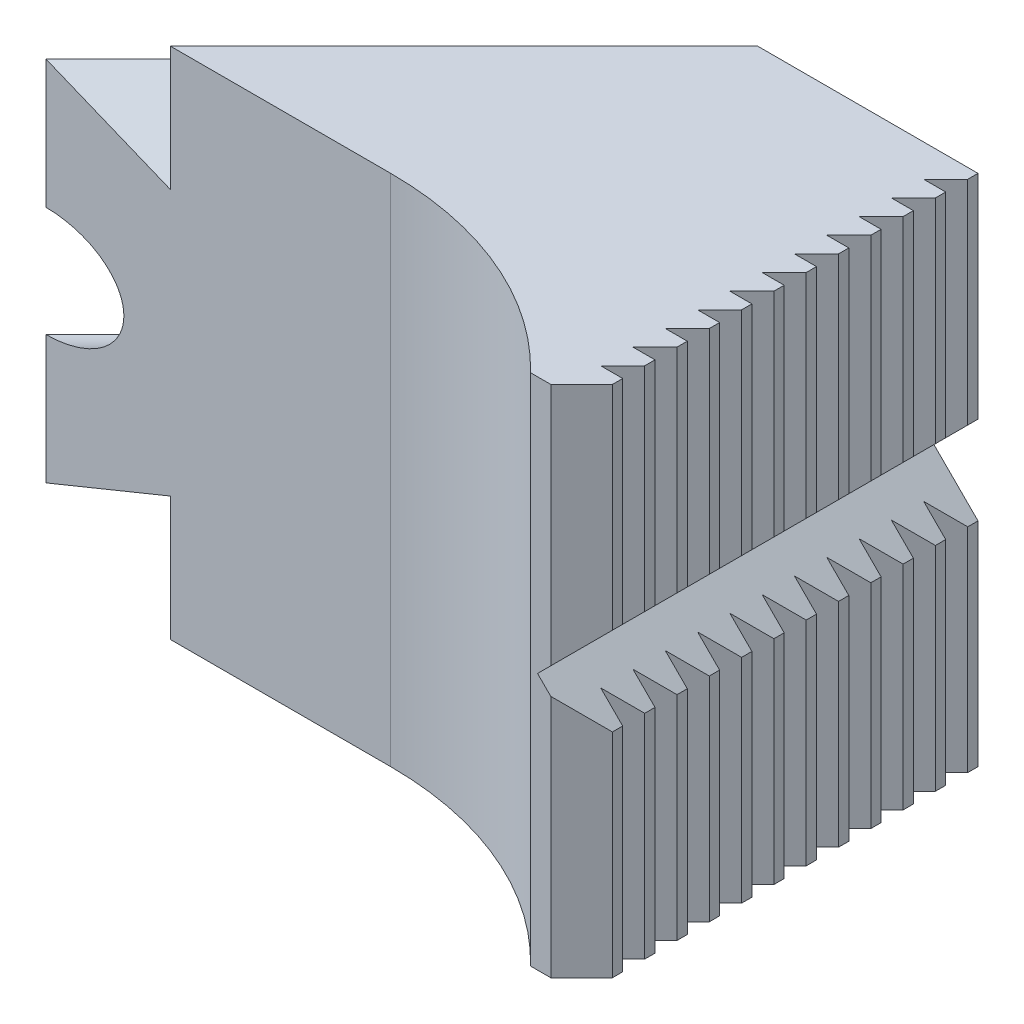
ISO-10303-21;
HEADER;
FILE_DESCRIPTION(('STEP AP214'),'2;1');
FILE_NAME('part.step','',(''),(''),'','','');
FILE_SCHEMA(('AUTOMOTIVE_DESIGN { 1 0 10303 214 1 1 1 1 }'));
ENDSEC;
DATA;
#1=APPLICATION_CONTEXT('core data for automotive mechanical design processes');
#2=APPLICATION_PROTOCOL_DEFINITION('international standard','automotive_design',2000,#1);
#3=PRODUCT_CONTEXT('',#1,'mechanical');
#4=PRODUCT('Part','Part','',(#3));
#5=PRODUCT_RELATED_PRODUCT_CATEGORY('part','',(#4));
#6=PRODUCT_DEFINITION_FORMATION('','',#4);
#7=PRODUCT_DEFINITION_CONTEXT('part definition',#1,'design');
#8=PRODUCT_DEFINITION('design','',#6,#7);
#9=PRODUCT_DEFINITION_SHAPE('','',#8);
#10=(LENGTH_UNIT() NAMED_UNIT(*) SI_UNIT(.MILLI.,.METRE.));
#11=(NAMED_UNIT(*) PLANE_ANGLE_UNIT() SI_UNIT($,.RADIAN.));
#12=(NAMED_UNIT(*) SI_UNIT($,.STERADIAN.) SOLID_ANGLE_UNIT());
#13=UNCERTAINTY_MEASURE_WITH_UNIT(LENGTH_MEASURE(1.E-05),#10,'distance_accuracy_value','');
#14=(GEOMETRIC_REPRESENTATION_CONTEXT(3) GLOBAL_UNCERTAINTY_ASSIGNED_CONTEXT((#13)) GLOBAL_UNIT_ASSIGNED_CONTEXT((#10,
#11,#12)) REPRESENTATION_CONTEXT('',''));
#15=CARTESIAN_POINT('',(0.,0.,0.));
#16=DIRECTION('',(0.,0.,1.));
#17=DIRECTION('',(1.,0.,0.));
#18=AXIS2_PLACEMENT_3D('',#15,#16,#17);
#19=CARTESIAN_POINT('',(-110.872998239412,9.03589838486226,119.358279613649));
#20=DIRECTION('',(-0.707106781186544,0.,-0.707106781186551));
#21=DIRECTION('',(0.707106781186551,0.,-0.707106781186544));
#22=AXIS2_PLACEMENT_3D('',#19,#20,#21);
#23=PLANE('',#22);
#24=DIRECTION('',(0.,1.,0.));
#25=VECTOR('',#24,1.);
#26=CARTESIAN_POINT('',(8.48528137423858,17.5,0.));
#27=LINE('',#26,#25);
#28=CARTESIAN_POINT('',(8.48528137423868,9.03589838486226,0.));
#29=VERTEX_POINT('',#28);
#30=CARTESIAN_POINT('',(8.48528137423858,17.5,0.));
#31=VERTEX_POINT('',#30);
#32=EDGE_CURVE('E615',#29,#31,#27,.T.);
#33=ORIENTED_EDGE('',*,*,#32,.F.);
#34=DIRECTION('',(0.707106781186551,0.,-0.707106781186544));
#35=VECTOR('',#34,1.);
#36=CARTESIAN_POINT('',(-110.872998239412,9.03589838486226,119.358279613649));
#37=LINE('',#36,#35);
#38=CARTESIAN_POINT('',(-11.5147186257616,9.03589838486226,20.));
#39=VERTEX_POINT('',#38);
#40=EDGE_CURVE('E605',#39,#29,#37,.T.);
#41=ORIENTED_EDGE('',*,*,#40,.F.);
#42=DIRECTION('',(0.,-1.,0.));
#43=VECTOR('',#42,1.);
#44=CARTESIAN_POINT('',(-11.5147186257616,17.5,20.));
#45=LINE('',#44,#43);
#46=CARTESIAN_POINT('',(-11.5147186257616,17.5,20.));
#47=VERTEX_POINT('',#46);
#48=EDGE_CURVE('E595',#47,#39,#45,.T.);
#49=ORIENTED_EDGE('',*,*,#48,.F.);
#50=DIRECTION('',(-0.707106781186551,0.,0.707106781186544));
#51=VECTOR('',#50,1.);
#52=CARTESIAN_POINT('',(-15.5173593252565,17.5,24.0026406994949));
#53=LINE('',#52,#51);
#54=EDGE_CURVE('E1213',#31,#47,#53,.T.);
#55=ORIENTED_EDGE('',*,*,#54,.F.);
#56=EDGE_LOOP('',(#33,#41,#49,#55));
#57=FACE_BOUND('',#56,.T.);
#58=ADVANCED_FACE('F14',(#57),#23,.T.);
#59=CARTESIAN_POINT('',(-110.872998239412,9.03589838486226,119.358279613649));
#60=DIRECTION('',(0.353553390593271,0.86602540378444,0.353553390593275));
#61=DIRECTION('',(0.,0.377964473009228,-0.925820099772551));
#62=AXIS2_PLACEMENT_3D('',#59,#60,#61);
#63=PLANE('',#62);
#64=DIRECTION('',(0.925820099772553,-0.377964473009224,0.));
#65=VECTOR('',#64,1.);
#66=CARTESIAN_POINT('',(-1.74963555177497,13.2142857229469,0.));
#67=LINE('',#66,#65);
#68=CARTESIAN_POINT('',(0.,12.5,0.));
#69=VERTEX_POINT('',#68);
#70=EDGE_CURVE('E622',#69,#29,#67,.T.);
#71=ORIENTED_EDGE('',*,*,#70,.F.);
#72=DIRECTION('',(0.707106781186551,0.,-0.707106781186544));
#73=VECTOR('',#72,1.);
#74=CARTESIAN_POINT('',(-115.115638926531,12.5,115.11563892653));
#75=LINE('',#74,#73);
#76=CARTESIAN_POINT('',(-20.,12.5,20.));
#77=VERTEX_POINT('',#76);
#78=EDGE_CURVE('E601',#77,#69,#75,.T.);
#79=ORIENTED_EDGE('',*,*,#78,.F.);
#80=DIRECTION('',(-0.925820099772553,0.377964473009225,0.));
#81=VECTOR('',#80,1.);
#82=CARTESIAN_POINT('',(-1.62392126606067,4.9979972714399,20.));
#83=LINE('',#82,#81);
#84=EDGE_CURVE('E22',#39,#77,#83,.T.);
#85=ORIENTED_EDGE('',*,*,#84,.F.);
#86=ORIENTED_EDGE('',*,*,#40,.T.);
#87=EDGE_LOOP('',(#71,#79,#85,#86));
#88=FACE_BOUND('',#87,.T.);
#89=ADVANCED_FACE('F1227',(#88),#63,.T.);
#90=CARTESIAN_POINT('',(-110.872998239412,-9.03589838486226,119.358279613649));
#91=DIRECTION('',(-0.707106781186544,0.,-0.707106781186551));
#92=DIRECTION('',(0.707106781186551,0.,-0.707106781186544));
#93=AXIS2_PLACEMENT_3D('',#90,#91,#92);
#94=PLANE('',#93);
#95=DIRECTION('',(0.,1.,0.));
#96=VECTOR('',#95,1.);
#97=CARTESIAN_POINT('',(8.48528137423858,17.5,0.));
#98=LINE('',#97,#96);
#99=CARTESIAN_POINT('',(8.48528137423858,-17.5,0.));
#100=VERTEX_POINT('',#99);
#101=CARTESIAN_POINT('',(8.48528137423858,-9.03589838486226,0.));
#102=VERTEX_POINT('',#101);
#103=EDGE_CURVE('E29',#100,#102,#98,.T.);
#104=ORIENTED_EDGE('',*,*,#103,.F.);
#105=DIRECTION('',(-0.707106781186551,0.,0.707106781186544));
#106=VECTOR('',#105,1.);
#107=CARTESIAN_POINT('',(-15.5173593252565,-17.5,24.0026406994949));
#108=LINE('',#107,#106);
#109=CARTESIAN_POINT('',(-11.5147186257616,-17.5,20.));
#110=VERTEX_POINT('',#109);
#111=EDGE_CURVE('E1216',#100,#110,#108,.T.);
#112=ORIENTED_EDGE('',*,*,#111,.T.);
#113=DIRECTION('',(0.,-1.,0.));
#114=VECTOR('',#113,1.);
#115=CARTESIAN_POINT('',(-11.5147186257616,17.5,20.));
#116=LINE('',#115,#114);
#117=CARTESIAN_POINT('',(-11.5147186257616,-9.03589838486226,20.));
#118=VERTEX_POINT('',#117);
#119=EDGE_CURVE('E618',#118,#110,#116,.T.);
#120=ORIENTED_EDGE('',*,*,#119,.F.);
#121=DIRECTION('',(0.707106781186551,0.,-0.707106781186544));
#122=VECTOR('',#121,1.);
#123=CARTESIAN_POINT('',(-110.872998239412,-9.03589838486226,119.358279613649));
#124=LINE('',#123,#122);
#125=EDGE_CURVE('E596',#118,#102,#124,.T.);
#126=ORIENTED_EDGE('',*,*,#125,.T.);
#127=EDGE_LOOP('',(#104,#112,#120,#126));
#128=FACE_BOUND('',#127,.T.);
#129=ADVANCED_FACE('F1240',(#128),#94,.T.);
#130=CARTESIAN_POINT('',(-110.872998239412,-9.03589838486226,119.358279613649));
#131=DIRECTION('',(0.353553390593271,-0.86602540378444,0.353553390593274));
#132=DIRECTION('',(0.,0.377964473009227,0.925820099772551));
#133=AXIS2_PLACEMENT_3D('',#130,#131,#132);
#134=PLANE('',#133);
#135=DIRECTION('',(-0.925820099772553,-0.377964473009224,0.));
#136=VECTOR('',#135,1.);
#137=CARTESIAN_POINT('',(10.4978131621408,-8.21428572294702,0.));
#138=LINE('',#137,#136);
#139=CARTESIAN_POINT('',(0.,-12.5,0.));
#140=VERTEX_POINT('',#139);
#141=EDGE_CURVE('E625',#102,#140,#138,.T.);
#142=ORIENTED_EDGE('',*,*,#141,.F.);
#143=ORIENTED_EDGE('',*,*,#125,.F.);
#144=DIRECTION('',(0.925820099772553,0.377964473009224,0.));
#145=VECTOR('',#144,1.);
#146=CARTESIAN_POINT('',(10.6235274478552,0.002002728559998,20.));
#147=LINE('',#146,#145);
#148=CARTESIAN_POINT('',(-20.,-12.5,20.));
#149=VERTEX_POINT('',#148);
#150=EDGE_CURVE('E9',#149,#118,#147,.T.);
#151=ORIENTED_EDGE('',*,*,#150,.F.);
#152=DIRECTION('',(0.707106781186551,0.,-0.707106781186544));
#153=VECTOR('',#152,1.);
#154=CARTESIAN_POINT('',(-115.115638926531,-12.5,115.11563892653));
#155=LINE('',#154,#153);
#156=EDGE_CURVE('E603',#149,#140,#155,.T.);
#157=ORIENTED_EDGE('',*,*,#156,.T.);
#158=EDGE_LOOP('',(#142,#143,#151,#157));
#159=FACE_BOUND('',#158,.T.);
#160=ADVANCED_FACE('F1236',(#159),#134,.T.);
#161=CARTESIAN_POINT('',(-115.115638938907,0.,115.115638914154));
#162=DIRECTION('',(0.707106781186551,0.,-0.707106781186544));
#163=DIRECTION('',(0.707106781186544,0.,0.707106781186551));
#164=AXIS2_PLACEMENT_3D('',#161,#162,#163);
#165=CYLINDRICAL_SURFACE('',#164,6.9);
#166=DIRECTION('',(0.707106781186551,0.,-0.707106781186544));
#167=VECTOR('',#166,1.);
#168=CARTESIAN_POINT('',(-115.115638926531,6.9,115.11563892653));
#169=LINE('',#168,#167);
#170=CARTESIAN_POINT('',(-13.9895923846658,6.9,13.9895923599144));
#171=VERTEX_POINT('',#170);
#172=CARTESIAN_POINT('',(-4.09009743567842,6.9,4.09009743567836));
#173=VERTEX_POINT('',#172);
#174=EDGE_CURVE('E584',#171,#173,#169,.T.);
#175=ORIENTED_EDGE('',*,*,#174,.T.);
#176=CARTESIAN_POINT('',(-4.09009744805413,0.,4.09009742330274));
#177=DIRECTION('',(-0.707106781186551,0.,0.707106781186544));
#178=DIRECTION('',(-0.707106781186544,0.,-0.707106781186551));
#179=AXIS2_PLACEMENT_3D('',#176,#177,#178);
#180=CIRCLE('',#179,6.9);
#181=CARTESIAN_POINT('',(-4.09009743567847,-6.9,4.09009743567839));
#182=VERTEX_POINT('',#181);
#183=EDGE_CURVE('E592',#173,#182,#180,.T.);
#184=ORIENTED_EDGE('',*,*,#183,.T.);
#185=DIRECTION('',(0.707106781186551,0.,-0.707106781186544));
#186=VECTOR('',#185,1.);
#187=CARTESIAN_POINT('',(-115.115638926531,-6.9,115.11563892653));
#188=LINE('',#187,#186);
#189=CARTESIAN_POINT('',(-13.9895923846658,-6.9,13.9895923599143));
#190=VERTEX_POINT('',#189);
#191=EDGE_CURVE('E586',#190,#182,#188,.T.);
#192=ORIENTED_EDGE('',*,*,#191,.F.);
#193=CARTESIAN_POINT('',(-13.9895923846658,0.,13.9895923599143));
#194=DIRECTION('',(-0.707106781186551,0.,0.707106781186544));
#195=DIRECTION('',(-0.707106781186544,0.,-0.707106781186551));
#196=AXIS2_PLACEMENT_3D('',#193,#194,#195);
#197=CIRCLE('',#196,6.9);
#198=EDGE_CURVE('E600',#171,#190,#197,.T.);
#199=ORIENTED_EDGE('',*,*,#198,.F.);
#200=EDGE_LOOP('',(#175,#184,#192,#199));
#201=FACE_BOUND('',#200,.T.);
#202=ADVANCED_FACE('F599',(#201),#165,.T.);
#203=CARTESIAN_POINT('',(-2.47515272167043E-08,17.5,0.));
#204=DIRECTION('',(0.,0.,-1.));
#205=DIRECTION('',(-1.,0.,0.));
#206=AXIS2_PLACEMENT_3D('',#203,#204,#205);
#207=PLANE('',#206);
#208=DIRECTION('',(1.,0.,0.));
#209=VECTOR('',#208,1.);
#210=CARTESIAN_POINT('',(-2.47515272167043E-08,-17.5,0.));
#211=LINE('',#210,#209);
#212=CARTESIAN_POINT('',(23.4799999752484,-17.5,0.));
#213=VERTEX_POINT('',#212);
#214=EDGE_CURVE('E883',#100,#213,#211,.T.);
#215=ORIENTED_EDGE('',*,*,#214,.F.);
#216=ORIENTED_EDGE('',*,*,#103,.T.);
#217=ORIENTED_EDGE('',*,*,#141,.T.);
#218=DIRECTION('',(0.,-1.,0.));
#219=VECTOR('',#218,1.);
#220=CARTESIAN_POINT('',(-2.47515272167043E-08,17.5,0.));
#221=LINE('',#220,#219);
#222=EDGE_CURVE('E37',#69,#140,#221,.T.);
#223=ORIENTED_EDGE('',*,*,#222,.F.);
#224=ORIENTED_EDGE('',*,*,#70,.T.);
#225=ORIENTED_EDGE('',*,*,#32,.T.);
#226=DIRECTION('',(1.,0.,0.));
#227=VECTOR('',#226,1.);
#228=CARTESIAN_POINT('',(-2.47515272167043E-08,17.5,0.));
#229=LINE('',#228,#227);
#230=CARTESIAN_POINT('',(23.4799999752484,17.5,0.));
#231=VERTEX_POINT('',#230);
#232=EDGE_CURVE('E998',#31,#231,#229,.T.);
#233=ORIENTED_EDGE('',*,*,#232,.T.);
#234=DIRECTION('',(0.,-1.,0.));
#235=VECTOR('',#234,1.);
#236=CARTESIAN_POINT('',(23.4799999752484,17.5,0.));
#237=LINE('',#236,#235);
#238=CARTESIAN_POINT('',(23.4799999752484,3.00000000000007,0.));
#239=VERTEX_POINT('',#238);
#240=EDGE_CURVE('E1006',#231,#239,#237,.T.);
#241=ORIENTED_EDGE('',*,*,#240,.T.);
#242=DIRECTION('',(-0.707106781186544,-0.707106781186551,0.));
#243=VECTOR('',#242,1.);
#244=CARTESIAN_POINT('',(23.4799999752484,3.00000000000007,0.));
#245=LINE('',#244,#243);
#246=CARTESIAN_POINT('',(20.4799999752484,0.,0.));
#247=VERTEX_POINT('',#246);
#248=EDGE_CURVE('E627',#239,#247,#245,.T.);
#249=ORIENTED_EDGE('',*,*,#248,.T.);
#250=DIRECTION('',(-0.707106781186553,0.707106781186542,0.));
#251=VECTOR('',#250,1.);
#252=CARTESIAN_POINT('',(23.4799999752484,-3.,0.));
#253=LINE('',#252,#251);
#254=CARTESIAN_POINT('',(23.4799999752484,-3.,0.));
#255=VERTEX_POINT('',#254);
#256=EDGE_CURVE('E628',#255,#247,#253,.T.);
#257=ORIENTED_EDGE('',*,*,#256,.F.);
#258=EDGE_CURVE('E1005',#255,#213,#237,.T.);
#259=ORIENTED_EDGE('',*,*,#258,.T.);
#260=EDGE_LOOP('',(#215,#216,#217,#223,#224,#225,#233,#241,#249,#257,#259));
#261=FACE_BOUND('',#260,.T.);
#262=ADVANCED_FACE('F1245',(#261),#207,.T.);
#263=CARTESIAN_POINT('',(3.47999997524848,17.5,20.));
#264=DIRECTION('',(0.,0.,1.));
#265=DIRECTION('',(1.,0.,0.));
#266=AXIS2_PLACEMENT_3D('',#263,#264,#265);
#267=PLANE('',#266);
#268=ORIENTED_EDGE('',*,*,#150,.T.);
#269=ORIENTED_EDGE('',*,*,#119,.T.);
#270=DIRECTION('',(-1.,0.,0.));
#271=VECTOR('',#270,1.);
#272=CARTESIAN_POINT('',(3.47999997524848,-17.5,20.));
#273=LINE('',#272,#271);
#274=CARTESIAN_POINT('',(3.47999997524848,-17.5,20.));
#275=VERTEX_POINT('',#274);
#276=EDGE_CURVE('E770',#275,#110,#273,.T.);
#277=ORIENTED_EDGE('',*,*,#276,.F.);
#278=DIRECTION('',(0.,-1.,0.));
#279=VECTOR('',#278,1.);
#280=CARTESIAN_POINT('',(3.47999997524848,17.5,20.));
#281=LINE('',#280,#279);
#282=CARTESIAN_POINT('',(3.47999997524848,17.5,20.));
#283=VERTEX_POINT('',#282);
#284=EDGE_CURVE('E1151',#283,#275,#281,.T.);
#285=ORIENTED_EDGE('',*,*,#284,.F.);
#286=DIRECTION('',(-1.,0.,0.));
#287=VECTOR('',#286,1.);
#288=CARTESIAN_POINT('',(3.47999997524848,17.5,20.));
#289=LINE('',#288,#287);
#290=EDGE_CURVE('E774',#283,#47,#289,.T.);
#291=ORIENTED_EDGE('',*,*,#290,.T.);
#292=ORIENTED_EDGE('',*,*,#48,.T.);
#293=ORIENTED_EDGE('',*,*,#84,.T.);
#294=DIRECTION('',(0.,-1.,0.));
#295=VECTOR('',#294,1.);
#296=CARTESIAN_POINT('',(-20.0000000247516,17.5,20.));
#297=LINE('',#296,#295);
#298=CARTESIAN_POINT('',(-20.0000000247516,3.75,20.));
#299=VERTEX_POINT('',#298);
#300=EDGE_CURVE('E1002',#77,#299,#297,.T.);
#301=ORIENTED_EDGE('',*,*,#300,.T.);
#302=CARTESIAN_POINT('',(-20.0000000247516,0.,20.));
#303=DIRECTION('',(0.,0.,1.));
#304=DIRECTION('',(-1.,0.,0.));
#305=AXIS2_PLACEMENT_3D('',#302,#303,#304);
#306=ELLIPSE('',#305,5.30330085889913,3.75);
#307=CARTESIAN_POINT('',(-20.0000000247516,-3.75,20.));
#308=VERTEX_POINT('',#307);
#309=EDGE_CURVE('E767',#308,#299,#306,.T.);
#310=ORIENTED_EDGE('',*,*,#309,.F.);
#311=EDGE_CURVE('E889',#308,#149,#297,.T.);
#312=ORIENTED_EDGE('',*,*,#311,.T.);
#313=EDGE_LOOP('',(#268,#269,#277,#285,#291,#292,#293,#301,#310,#312));
#314=FACE_BOUND('',#313,.T.);
#315=ADVANCED_FACE('F1221',(#314),#267,.T.);
#316=CARTESIAN_POINT('',(3.47999997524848,-17.5,43.));
#317=DIRECTION('',(0.,1.,0.));
#318=DIRECTION('',(0.,0.,1.));
#319=AXIS2_PLACEMENT_3D('',#316,#317,#318);
#320=PLANE('',#319);
#321=ORIENTED_EDGE('',*,*,#111,.F.);
#322=ORIENTED_EDGE('',*,*,#214,.T.);
#323=DIRECTION('',(0.,0.,-1.));
#324=VECTOR('',#323,1.);
#325=CARTESIAN_POINT('',(23.4799999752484,-17.5,0.7));
#326=LINE('',#325,#324);
#327=CARTESIAN_POINT('',(23.4799999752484,-17.5,0.7));
#328=VERTEX_POINT('',#327);
#329=EDGE_CURVE('E880',#328,#213,#326,.T.);
#330=ORIENTED_EDGE('',*,*,#329,.F.);
#331=DIRECTION('',(-0.707106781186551,0.,0.707106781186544));
#332=VECTOR('',#331,1.);
#333=CARTESIAN_POINT('',(23.4799999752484,-17.5,0.7));
#334=LINE('',#333,#332);
#335=CARTESIAN_POINT('',(21.9799999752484,-17.5,2.2));
#336=VERTEX_POINT('',#335);
#337=EDGE_CURVE('E877',#328,#336,#334,.T.);
#338=ORIENTED_EDGE('',*,*,#337,.T.);
#339=DIRECTION('',(-1.,0.,0.));
#340=VECTOR('',#339,1.);
#341=CARTESIAN_POINT('',(23.4799999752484,-17.5,2.2));
#342=LINE('',#341,#340);
#343=CARTESIAN_POINT('',(23.4799999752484,-17.5,2.2));
#344=VERTEX_POINT('',#343);
#345=EDGE_CURVE('E874',#344,#336,#342,.T.);
#346=ORIENTED_EDGE('',*,*,#345,.F.);
#347=DIRECTION('',(0.,0.,-1.));
#348=VECTOR('',#347,1.);
#349=CARTESIAN_POINT('',(23.4799999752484,-17.5,2.9));
#350=LINE('',#349,#348);
#351=CARTESIAN_POINT('',(23.4799999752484,-17.5,2.9));
#352=VERTEX_POINT('',#351);
#353=EDGE_CURVE('E871',#352,#344,#350,.T.);
#354=ORIENTED_EDGE('',*,*,#353,.F.);
#355=DIRECTION('',(-0.707106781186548,0.,0.707106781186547));
#356=VECTOR('',#355,1.);
#357=CARTESIAN_POINT('',(23.4799999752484,-17.5,2.9));
#358=LINE('',#357,#356);
#359=CARTESIAN_POINT('',(21.9799999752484,-17.5,4.4));
#360=VERTEX_POINT('',#359);
#361=EDGE_CURVE('E868',#352,#360,#358,.T.);
#362=ORIENTED_EDGE('',*,*,#361,.T.);
#363=DIRECTION('',(-1.,0.,0.));
#364=VECTOR('',#363,1.);
#365=CARTESIAN_POINT('',(23.4799999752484,-17.5,4.4));
#366=LINE('',#365,#364);
#367=CARTESIAN_POINT('',(23.4799999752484,-17.5,4.4));
#368=VERTEX_POINT('',#367);
#369=EDGE_CURVE('E865',#368,#360,#366,.T.);
#370=ORIENTED_EDGE('',*,*,#369,.F.);
#371=DIRECTION('',(0.,0.,-1.));
#372=VECTOR('',#371,1.);
#373=CARTESIAN_POINT('',(23.4799999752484,-17.5,5.1));
#374=LINE('',#373,#372);
#375=CARTESIAN_POINT('',(23.4799999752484,-17.5,5.1));
#376=VERTEX_POINT('',#375);
#377=EDGE_CURVE('E862',#376,#368,#374,.T.);
#378=ORIENTED_EDGE('',*,*,#377,.F.);
#379=DIRECTION('',(-0.707106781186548,0.,0.707106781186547));
#380=VECTOR('',#379,1.);
#381=CARTESIAN_POINT('',(23.4799999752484,-17.5,5.1));
#382=LINE('',#381,#380);
#383=CARTESIAN_POINT('',(21.9799999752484,-17.5,6.6));
#384=VERTEX_POINT('',#383);
#385=EDGE_CURVE('E859',#376,#384,#382,.T.);
#386=ORIENTED_EDGE('',*,*,#385,.T.);
#387=DIRECTION('',(-1.,0.,0.));
#388=VECTOR('',#387,1.);
#389=CARTESIAN_POINT('',(23.4799999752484,-17.5,6.6));
#390=LINE('',#389,#388);
#391=CARTESIAN_POINT('',(23.4799999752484,-17.5,6.6));
#392=VERTEX_POINT('',#391);
#393=EDGE_CURVE('E856',#392,#384,#390,.T.);
#394=ORIENTED_EDGE('',*,*,#393,.F.);
#395=DIRECTION('',(0.,0.,-1.));
#396=VECTOR('',#395,1.);
#397=CARTESIAN_POINT('',(23.4799999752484,-17.5,7.3));
#398=LINE('',#397,#396);
#399=CARTESIAN_POINT('',(23.4799999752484,-17.5,7.3));
#400=VERTEX_POINT('',#399);
#401=EDGE_CURVE('E853',#400,#392,#398,.T.);
#402=ORIENTED_EDGE('',*,*,#401,.F.);
#403=DIRECTION('',(-0.707106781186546,0.,0.707106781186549));
#404=VECTOR('',#403,1.);
#405=CARTESIAN_POINT('',(23.4799999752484,-17.5,7.3));
#406=LINE('',#405,#404);
#407=CARTESIAN_POINT('',(21.9799999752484,-17.5,8.8));
#408=VERTEX_POINT('',#407);
#409=EDGE_CURVE('E850',#400,#408,#406,.T.);
#410=ORIENTED_EDGE('',*,*,#409,.T.);
#411=DIRECTION('',(-1.,0.,0.));
#412=VECTOR('',#411,1.);
#413=CARTESIAN_POINT('',(23.4799999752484,-17.5,8.8));
#414=LINE('',#413,#412);
#415=CARTESIAN_POINT('',(23.4799999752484,-17.5,8.8));
#416=VERTEX_POINT('',#415);
#417=EDGE_CURVE('E847',#416,#408,#414,.T.);
#418=ORIENTED_EDGE('',*,*,#417,.F.);
#419=DIRECTION('',(0.,0.,-1.));
#420=VECTOR('',#419,1.);
#421=CARTESIAN_POINT('',(23.4799999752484,-17.5,9.5));
#422=LINE('',#421,#420);
#423=CARTESIAN_POINT('',(23.4799999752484,-17.5,9.5));
#424=VERTEX_POINT('',#423);
#425=EDGE_CURVE('E844',#424,#416,#422,.T.);
#426=ORIENTED_EDGE('',*,*,#425,.F.);
#427=DIRECTION('',(-0.707106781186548,0.,0.707106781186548));
#428=VECTOR('',#427,1.);
#429=CARTESIAN_POINT('',(23.4799999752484,-17.5,9.5));
#430=LINE('',#429,#428);
#431=CARTESIAN_POINT('',(21.9799999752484,-17.5,11.));
#432=VERTEX_POINT('',#431);
#433=EDGE_CURVE('E841',#424,#432,#430,.T.);
#434=ORIENTED_EDGE('',*,*,#433,.T.);
#435=DIRECTION('',(-1.,0.,0.));
#436=VECTOR('',#435,1.);
#437=CARTESIAN_POINT('',(23.4799999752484,-17.5,11.));
#438=LINE('',#437,#436);
#439=CARTESIAN_POINT('',(23.4799999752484,-17.5,11.));
#440=VERTEX_POINT('',#439);
#441=EDGE_CURVE('E838',#440,#432,#438,.T.);
#442=ORIENTED_EDGE('',*,*,#441,.F.);
#443=DIRECTION('',(0.,0.,-1.));
#444=VECTOR('',#443,1.);
#445=CARTESIAN_POINT('',(23.4799999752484,-17.5,11.7));
#446=LINE('',#445,#444);
#447=CARTESIAN_POINT('',(23.4799999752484,-17.5,11.7));
#448=VERTEX_POINT('',#447);
#449=EDGE_CURVE('E835',#448,#440,#446,.T.);
#450=ORIENTED_EDGE('',*,*,#449,.F.);
#451=DIRECTION('',(-0.707106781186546,0.,0.707106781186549));
#452=VECTOR('',#451,1.);
#453=CARTESIAN_POINT('',(23.4799999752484,-17.5,11.7));
#454=LINE('',#453,#452);
#455=CARTESIAN_POINT('',(21.9799999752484,-17.5,13.2));
#456=VERTEX_POINT('',#455);
#457=EDGE_CURVE('E832',#448,#456,#454,.T.);
#458=ORIENTED_EDGE('',*,*,#457,.T.);
#459=DIRECTION('',(1.,0.,0.));
#460=VECTOR('',#459,1.);
#461=CARTESIAN_POINT('',(21.9799999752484,-17.5,13.2));
#462=LINE('',#461,#460);
#463=CARTESIAN_POINT('',(23.4799999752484,-17.5,13.2));
#464=VERTEX_POINT('',#463);
#465=EDGE_CURVE('E829',#456,#464,#462,.T.);
#466=ORIENTED_EDGE('',*,*,#465,.T.);
#467=DIRECTION('',(0.,0.,-1.));
#468=VECTOR('',#467,1.);
#469=CARTESIAN_POINT('',(23.4799999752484,-17.5,13.9));
#470=LINE('',#469,#468);
#471=CARTESIAN_POINT('',(23.4799999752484,-17.5,13.9));
#472=VERTEX_POINT('',#471);
#473=EDGE_CURVE('E826',#472,#464,#470,.T.);
#474=ORIENTED_EDGE('',*,*,#473,.F.);
#475=DIRECTION('',(-0.707106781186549,0.,0.707106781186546));
#476=VECTOR('',#475,1.);
#477=CARTESIAN_POINT('',(23.4799999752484,-17.5,13.9));
#478=LINE('',#477,#476);
#479=CARTESIAN_POINT('',(21.9799999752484,-17.5,15.4));
#480=VERTEX_POINT('',#479);
#481=EDGE_CURVE('E823',#472,#480,#478,.T.);
#482=ORIENTED_EDGE('',*,*,#481,.T.);
#483=DIRECTION('',(-1.,0.,0.));
#484=VECTOR('',#483,1.);
#485=CARTESIAN_POINT('',(23.4799999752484,-17.5,15.4));
#486=LINE('',#485,#484);
#487=CARTESIAN_POINT('',(23.4799999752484,-17.5,15.4));
#488=VERTEX_POINT('',#487);
#489=EDGE_CURVE('E820',#488,#480,#486,.T.);
#490=ORIENTED_EDGE('',*,*,#489,.F.);
#491=DIRECTION('',(0.,0.,-1.));
#492=VECTOR('',#491,1.);
#493=CARTESIAN_POINT('',(23.4799999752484,-17.5,16.1));
#494=LINE('',#493,#492);
#495=CARTESIAN_POINT('',(23.4799999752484,-17.5,16.1));
#496=VERTEX_POINT('',#495);
#497=EDGE_CURVE('E817',#496,#488,#494,.T.);
#498=ORIENTED_EDGE('',*,*,#497,.F.);
#499=DIRECTION('',(-0.707106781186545,0.,0.70710678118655));
#500=VECTOR('',#499,1.);
#501=CARTESIAN_POINT('',(23.4799999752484,-17.5,16.1));
#502=LINE('',#501,#500);
#503=CARTESIAN_POINT('',(21.9799999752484,-17.5,17.6));
#504=VERTEX_POINT('',#503);
#505=EDGE_CURVE('E814',#496,#504,#502,.T.);
#506=ORIENTED_EDGE('',*,*,#505,.T.);
#507=DIRECTION('',(-1.,0.,0.));
#508=VECTOR('',#507,1.);
#509=CARTESIAN_POINT('',(23.4799999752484,-17.5,17.6));
#510=LINE('',#509,#508);
#511=CARTESIAN_POINT('',(23.4799999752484,-17.5,17.6));
#512=VERTEX_POINT('',#511);
#513=EDGE_CURVE('E811',#512,#504,#510,.T.);
#514=ORIENTED_EDGE('',*,*,#513,.F.);
#515=DIRECTION('',(0.,0.,-1.));
#516=VECTOR('',#515,1.);
#517=CARTESIAN_POINT('',(23.4799999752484,-17.5,18.3));
#518=LINE('',#517,#516);
#519=CARTESIAN_POINT('',(23.4799999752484,-17.5,18.3));
#520=VERTEX_POINT('',#519);
#521=EDGE_CURVE('E808',#520,#512,#518,.T.);
#522=ORIENTED_EDGE('',*,*,#521,.F.);
#523=DIRECTION('',(-0.707106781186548,0.,0.707106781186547));
#524=VECTOR('',#523,1.);
#525=CARTESIAN_POINT('',(23.4799999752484,-17.5,18.3));
#526=LINE('',#525,#524);
#527=CARTESIAN_POINT('',(21.9799999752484,-17.5,19.8));
#528=VERTEX_POINT('',#527);
#529=EDGE_CURVE('E805',#520,#528,#526,.T.);
#530=ORIENTED_EDGE('',*,*,#529,.T.);
#531=DIRECTION('',(-1.,0.,0.));
#532=VECTOR('',#531,1.);
#533=CARTESIAN_POINT('',(23.4799999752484,-17.5,19.8));
#534=LINE('',#533,#532);
#535=CARTESIAN_POINT('',(23.4799999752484,-17.5,19.8));
#536=VERTEX_POINT('',#535);
#537=EDGE_CURVE('E802',#536,#528,#534,.T.);
#538=ORIENTED_EDGE('',*,*,#537,.F.);
#539=DIRECTION('',(0.,0.,-1.));
#540=VECTOR('',#539,1.);
#541=CARTESIAN_POINT('',(23.4799999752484,-17.5,20.5));
#542=LINE('',#541,#540);
#543=CARTESIAN_POINT('',(23.4799999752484,-17.5,20.5));
#544=VERTEX_POINT('',#543);
#545=EDGE_CURVE('E799',#544,#536,#542,.T.);
#546=ORIENTED_EDGE('',*,*,#545,.F.);
#547=DIRECTION('',(-0.707106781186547,0.,0.707106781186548));
#548=VECTOR('',#547,1.);
#549=CARTESIAN_POINT('',(23.4799999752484,-17.5,20.5));
#550=LINE('',#549,#548);
#551=CARTESIAN_POINT('',(21.9799999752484,-17.5,22.));
#552=VERTEX_POINT('',#551);
#553=EDGE_CURVE('E796',#544,#552,#550,.T.);
#554=ORIENTED_EDGE('',*,*,#553,.T.);
#555=DIRECTION('',(-1.,0.,0.));
#556=VECTOR('',#555,1.);
#557=CARTESIAN_POINT('',(23.4799999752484,-17.5,22.));
#558=LINE('',#557,#556);
#559=CARTESIAN_POINT('',(23.4799999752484,-17.5,22.));
#560=VERTEX_POINT('',#559);
#561=EDGE_CURVE('E793',#560,#552,#558,.T.);
#562=ORIENTED_EDGE('',*,*,#561,.F.);
#563=DIRECTION('',(0.,0.,-1.));
#564=VECTOR('',#563,1.);
#565=CARTESIAN_POINT('',(23.4799999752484,-17.5,22.7));
#566=LINE('',#565,#564);
#567=CARTESIAN_POINT('',(23.4799999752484,-17.5,22.7));
#568=VERTEX_POINT('',#567);
#569=EDGE_CURVE('E790',#568,#560,#566,.T.);
#570=ORIENTED_EDGE('',*,*,#569,.F.);
#571=DIRECTION('',(-0.707106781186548,0.,0.707106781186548));
#572=VECTOR('',#571,1.);
#573=CARTESIAN_POINT('',(23.4799999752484,-17.5,22.7));
#574=LINE('',#573,#572);
#575=CARTESIAN_POINT('',(21.9799999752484,-17.5,24.2));
#576=VERTEX_POINT('',#575);
#577=EDGE_CURVE('E787',#568,#576,#574,.T.);
#578=ORIENTED_EDGE('',*,*,#577,.T.);
#579=DIRECTION('',(-1.,0.,0.));
#580=VECTOR('',#579,1.);
#581=CARTESIAN_POINT('',(23.4799999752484,-17.5,24.2));
#582=LINE('',#581,#580);
#583=CARTESIAN_POINT('',(23.4799999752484,-17.5,24.2));
#584=VERTEX_POINT('',#583);
#585=EDGE_CURVE('E784',#584,#576,#582,.T.);
#586=ORIENTED_EDGE('',*,*,#585,.F.);
#587=DIRECTION('',(0.,0.,-1.));
#588=VECTOR('',#587,1.);
#589=CARTESIAN_POINT('',(23.4799999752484,-17.5,24.9));
#590=LINE('',#589,#588);
#591=CARTESIAN_POINT('',(23.4799999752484,-17.5,24.9));
#592=VERTEX_POINT('',#591);
#593=EDGE_CURVE('E781',#592,#584,#590,.T.);
#594=ORIENTED_EDGE('',*,*,#593,.F.);
#595=DIRECTION('',(-0.707106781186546,0.,0.707106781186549));
#596=VECTOR('',#595,1.);
#597=CARTESIAN_POINT('',(23.4799999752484,-17.5,24.9));
#598=LINE('',#597,#596);
#599=CARTESIAN_POINT('',(21.3799999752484,-17.5,27.));
#600=VERTEX_POINT('',#599);
#601=EDGE_CURVE('E778',#592,#600,#598,.T.);
#602=ORIENTED_EDGE('',*,*,#601,.T.);
#603=DIRECTION('',(-1.,0.,0.));
#604=VECTOR('',#603,1.);
#605=CARTESIAN_POINT('',(21.3799999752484,-17.5,27.));
#606=LINE('',#605,#604);
#607=CARTESIAN_POINT('',(20.0027116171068,-17.5,27.));
#608=VERTEX_POINT('',#607);
#609=EDGE_CURVE('E775',#600,#608,#606,.T.);
#610=ORIENTED_EDGE('',*,*,#609,.T.);
#611=CARTESIAN_POINT('',(3.47999997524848,-17.5,43.));
#612=DIRECTION('',(0.,1.,0.));
#613=DIRECTION('',(0.,0.,1.));
#614=AXIS2_PLACEMENT_3D('',#611,#612,#613);
#615=CIRCLE('',#614,23.);
#616=EDGE_CURVE('E771',#608,#275,#615,.T.);
#617=ORIENTED_EDGE('',*,*,#616,.T.);
#618=ORIENTED_EDGE('',*,*,#276,.T.);
#619=EDGE_LOOP('',(#321,#322,#330,#338,#346,#354,#362,#370,#378,#386,#394,#402,#410,#418,#426,
#434,#442,#450,#458,#466,#474,#482,#490,#498,#506,#514,#522,#530,#538,#546,#554,#562,#570,#578,
#586,#594,#602,#610,#617,#618));
#620=FACE_BOUND('',#619,.T.);
#621=ADVANCED_FACE('F1242',(#620),#320,.F.);
#622=CARTESIAN_POINT('',(3.47999997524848,17.5,43.));
#623=DIRECTION('',(0.,1.,0.));
#624=DIRECTION('',(0.,0.,1.));
#625=AXIS2_PLACEMENT_3D('',#622,#623,#624);
#626=PLANE('',#625);
#627=ORIENTED_EDGE('',*,*,#232,.F.);
#628=ORIENTED_EDGE('',*,*,#54,.T.);
#629=ORIENTED_EDGE('',*,*,#290,.F.);
#630=CARTESIAN_POINT('',(3.47999997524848,17.5,43.));
#631=DIRECTION('',(0.,1.,0.));
#632=DIRECTION('',(0.,0.,1.));
#633=AXIS2_PLACEMENT_3D('',#630,#631,#632);
#634=CIRCLE('',#633,23.);
#635=CARTESIAN_POINT('',(20.0027116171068,17.5,27.));
#636=VERTEX_POINT('',#635);
#637=EDGE_CURVE('E886',#636,#283,#634,.T.);
#638=ORIENTED_EDGE('',*,*,#637,.F.);
#639=DIRECTION('',(-1.,0.,0.));
#640=VECTOR('',#639,1.);
#641=CARTESIAN_POINT('',(21.3799999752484,17.5,27.));
#642=LINE('',#641,#640);
#643=CARTESIAN_POINT('',(21.3799999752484,17.5,27.));
#644=VERTEX_POINT('',#643);
#645=EDGE_CURVE('E890',#644,#636,#642,.T.);
#646=ORIENTED_EDGE('',*,*,#645,.F.);
#647=DIRECTION('',(-0.707106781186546,0.,0.707106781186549));
#648=VECTOR('',#647,1.);
#649=CARTESIAN_POINT('',(23.4799999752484,17.5,24.9));
#650=LINE('',#649,#648);
#651=CARTESIAN_POINT('',(23.4799999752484,17.5,24.9));
#652=VERTEX_POINT('',#651);
#653=EDGE_CURVE('E893',#652,#644,#650,.T.);
#654=ORIENTED_EDGE('',*,*,#653,.F.);
#655=DIRECTION('',(0.,0.,-1.));
#656=VECTOR('',#655,1.);
#657=CARTESIAN_POINT('',(23.4799999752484,17.5,24.9));
#658=LINE('',#657,#656);
#659=CARTESIAN_POINT('',(23.4799999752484,17.5,24.2));
#660=VERTEX_POINT('',#659);
#661=EDGE_CURVE('E896',#652,#660,#658,.T.);
#662=ORIENTED_EDGE('',*,*,#661,.T.);
#663=DIRECTION('',(-1.,0.,0.));
#664=VECTOR('',#663,1.);
#665=CARTESIAN_POINT('',(23.4799999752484,17.5,24.2));
#666=LINE('',#665,#664);
#667=CARTESIAN_POINT('',(21.9799999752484,17.5,24.2));
#668=VERTEX_POINT('',#667);
#669=EDGE_CURVE('E899',#660,#668,#666,.T.);
#670=ORIENTED_EDGE('',*,*,#669,.T.);
#671=DIRECTION('',(-0.707106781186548,0.,0.707106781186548));
#672=VECTOR('',#671,1.);
#673=CARTESIAN_POINT('',(23.4799999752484,17.5,22.7));
#674=LINE('',#673,#672);
#675=CARTESIAN_POINT('',(23.4799999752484,17.5,22.7));
#676=VERTEX_POINT('',#675);
#677=EDGE_CURVE('E902',#676,#668,#674,.T.);
#678=ORIENTED_EDGE('',*,*,#677,.F.);
#679=DIRECTION('',(0.,0.,-1.));
#680=VECTOR('',#679,1.);
#681=CARTESIAN_POINT('',(23.4799999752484,17.5,22.7));
#682=LINE('',#681,#680);
#683=CARTESIAN_POINT('',(23.4799999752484,17.5,22.));
#684=VERTEX_POINT('',#683);
#685=EDGE_CURVE('E905',#676,#684,#682,.T.);
#686=ORIENTED_EDGE('',*,*,#685,.T.);
#687=DIRECTION('',(-1.,0.,0.));
#688=VECTOR('',#687,1.);
#689=CARTESIAN_POINT('',(23.4799999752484,17.5,22.));
#690=LINE('',#689,#688);
#691=CARTESIAN_POINT('',(21.9799999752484,17.5,22.));
#692=VERTEX_POINT('',#691);
#693=EDGE_CURVE('E908',#684,#692,#690,.T.);
#694=ORIENTED_EDGE('',*,*,#693,.T.);
#695=DIRECTION('',(-0.707106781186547,0.,0.707106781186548));
#696=VECTOR('',#695,1.);
#697=CARTESIAN_POINT('',(23.4799999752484,17.5,20.5));
#698=LINE('',#697,#696);
#699=CARTESIAN_POINT('',(23.4799999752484,17.5,20.5));
#700=VERTEX_POINT('',#699);
#701=EDGE_CURVE('E911',#700,#692,#698,.T.);
#702=ORIENTED_EDGE('',*,*,#701,.F.);
#703=DIRECTION('',(0.,0.,-1.));
#704=VECTOR('',#703,1.);
#705=CARTESIAN_POINT('',(23.4799999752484,17.5,20.5));
#706=LINE('',#705,#704);
#707=CARTESIAN_POINT('',(23.4799999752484,17.5,19.8));
#708=VERTEX_POINT('',#707);
#709=EDGE_CURVE('E914',#700,#708,#706,.T.);
#710=ORIENTED_EDGE('',*,*,#709,.T.);
#711=DIRECTION('',(-1.,0.,0.));
#712=VECTOR('',#711,1.);
#713=CARTESIAN_POINT('',(23.4799999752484,17.5,19.8));
#714=LINE('',#713,#712);
#715=CARTESIAN_POINT('',(21.9799999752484,17.5,19.8));
#716=VERTEX_POINT('',#715);
#717=EDGE_CURVE('E917',#708,#716,#714,.T.);
#718=ORIENTED_EDGE('',*,*,#717,.T.);
#719=DIRECTION('',(-0.707106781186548,0.,0.707106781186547));
#720=VECTOR('',#719,1.);
#721=CARTESIAN_POINT('',(23.4799999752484,17.5,18.3));
#722=LINE('',#721,#720);
#723=CARTESIAN_POINT('',(23.4799999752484,17.5,18.3));
#724=VERTEX_POINT('',#723);
#725=EDGE_CURVE('E920',#724,#716,#722,.T.);
#726=ORIENTED_EDGE('',*,*,#725,.F.);
#727=DIRECTION('',(0.,0.,-1.));
#728=VECTOR('',#727,1.);
#729=CARTESIAN_POINT('',(23.4799999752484,17.5,18.3));
#730=LINE('',#729,#728);
#731=CARTESIAN_POINT('',(23.4799999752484,17.5,17.6));
#732=VERTEX_POINT('',#731);
#733=EDGE_CURVE('E923',#724,#732,#730,.T.);
#734=ORIENTED_EDGE('',*,*,#733,.T.);
#735=DIRECTION('',(-1.,0.,0.));
#736=VECTOR('',#735,1.);
#737=CARTESIAN_POINT('',(23.4799999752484,17.5,17.6));
#738=LINE('',#737,#736);
#739=CARTESIAN_POINT('',(21.9799999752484,17.5,17.6));
#740=VERTEX_POINT('',#739);
#741=EDGE_CURVE('E926',#732,#740,#738,.T.);
#742=ORIENTED_EDGE('',*,*,#741,.T.);
#743=DIRECTION('',(-0.707106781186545,0.,0.70710678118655));
#744=VECTOR('',#743,1.);
#745=CARTESIAN_POINT('',(23.4799999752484,17.5,16.1));
#746=LINE('',#745,#744);
#747=CARTESIAN_POINT('',(23.4799999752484,17.5,16.1));
#748=VERTEX_POINT('',#747);
#749=EDGE_CURVE('E929',#748,#740,#746,.T.);
#750=ORIENTED_EDGE('',*,*,#749,.F.);
#751=DIRECTION('',(0.,0.,-1.));
#752=VECTOR('',#751,1.);
#753=CARTESIAN_POINT('',(23.4799999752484,17.5,16.1));
#754=LINE('',#753,#752);
#755=CARTESIAN_POINT('',(23.4799999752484,17.5,15.4));
#756=VERTEX_POINT('',#755);
#757=EDGE_CURVE('E932',#748,#756,#754,.T.);
#758=ORIENTED_EDGE('',*,*,#757,.T.);
#759=DIRECTION('',(-1.,0.,0.));
#760=VECTOR('',#759,1.);
#761=CARTESIAN_POINT('',(23.4799999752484,17.5,15.4));
#762=LINE('',#761,#760);
#763=CARTESIAN_POINT('',(21.9799999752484,17.5,15.4));
#764=VERTEX_POINT('',#763);
#765=EDGE_CURVE('E935',#756,#764,#762,.T.);
#766=ORIENTED_EDGE('',*,*,#765,.T.);
#767=DIRECTION('',(-0.707106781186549,0.,0.707106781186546));
#768=VECTOR('',#767,1.);
#769=CARTESIAN_POINT('',(23.4799999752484,17.5,13.9));
#770=LINE('',#769,#768);
#771=CARTESIAN_POINT('',(23.4799999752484,17.5,13.9));
#772=VERTEX_POINT('',#771);
#773=EDGE_CURVE('E938',#772,#764,#770,.T.);
#774=ORIENTED_EDGE('',*,*,#773,.F.);
#775=DIRECTION('',(0.,0.,-1.));
#776=VECTOR('',#775,1.);
#777=CARTESIAN_POINT('',(23.4799999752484,17.5,13.9));
#778=LINE('',#777,#776);
#779=CARTESIAN_POINT('',(23.4799999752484,17.5,13.2));
#780=VERTEX_POINT('',#779);
#781=EDGE_CURVE('E941',#772,#780,#778,.T.);
#782=ORIENTED_EDGE('',*,*,#781,.T.);
#783=DIRECTION('',(1.,0.,0.));
#784=VECTOR('',#783,1.);
#785=CARTESIAN_POINT('',(21.9799999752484,17.5,13.2));
#786=LINE('',#785,#784);
#787=CARTESIAN_POINT('',(21.9799999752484,17.5,13.2));
#788=VERTEX_POINT('',#787);
#789=EDGE_CURVE('E944',#788,#780,#786,.T.);
#790=ORIENTED_EDGE('',*,*,#789,.F.);
#791=DIRECTION('',(-0.707106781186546,0.,0.707106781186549));
#792=VECTOR('',#791,1.);
#793=CARTESIAN_POINT('',(23.4799999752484,17.5,11.7));
#794=LINE('',#793,#792);
#795=CARTESIAN_POINT('',(23.4799999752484,17.5,11.7));
#796=VERTEX_POINT('',#795);
#797=EDGE_CURVE('E947',#796,#788,#794,.T.);
#798=ORIENTED_EDGE('',*,*,#797,.F.);
#799=DIRECTION('',(0.,0.,-1.));
#800=VECTOR('',#799,1.);
#801=CARTESIAN_POINT('',(23.4799999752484,17.5,11.7));
#802=LINE('',#801,#800);
#803=CARTESIAN_POINT('',(23.4799999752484,17.5,11.));
#804=VERTEX_POINT('',#803);
#805=EDGE_CURVE('E950',#796,#804,#802,.T.);
#806=ORIENTED_EDGE('',*,*,#805,.T.);
#807=DIRECTION('',(-1.,0.,0.));
#808=VECTOR('',#807,1.);
#809=CARTESIAN_POINT('',(23.4799999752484,17.5,11.));
#810=LINE('',#809,#808);
#811=CARTESIAN_POINT('',(21.9799999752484,17.5,11.));
#812=VERTEX_POINT('',#811);
#813=EDGE_CURVE('E953',#804,#812,#810,.T.);
#814=ORIENTED_EDGE('',*,*,#813,.T.);
#815=DIRECTION('',(-0.707106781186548,0.,0.707106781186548));
#816=VECTOR('',#815,1.);
#817=CARTESIAN_POINT('',(23.4799999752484,17.5,9.5));
#818=LINE('',#817,#816);
#819=CARTESIAN_POINT('',(23.4799999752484,17.5,9.5));
#820=VERTEX_POINT('',#819);
#821=EDGE_CURVE('E956',#820,#812,#818,.T.);
#822=ORIENTED_EDGE('',*,*,#821,.F.);
#823=DIRECTION('',(0.,0.,-1.));
#824=VECTOR('',#823,1.);
#825=CARTESIAN_POINT('',(23.4799999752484,17.5,9.5));
#826=LINE('',#825,#824);
#827=CARTESIAN_POINT('',(23.4799999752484,17.5,8.8));
#828=VERTEX_POINT('',#827);
#829=EDGE_CURVE('E959',#820,#828,#826,.T.);
#830=ORIENTED_EDGE('',*,*,#829,.T.);
#831=DIRECTION('',(-1.,0.,0.));
#832=VECTOR('',#831,1.);
#833=CARTESIAN_POINT('',(23.4799999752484,17.5,8.8));
#834=LINE('',#833,#832);
#835=CARTESIAN_POINT('',(21.9799999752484,17.5,8.8));
#836=VERTEX_POINT('',#835);
#837=EDGE_CURVE('E962',#828,#836,#834,.T.);
#838=ORIENTED_EDGE('',*,*,#837,.T.);
#839=DIRECTION('',(-0.707106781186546,0.,0.707106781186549));
#840=VECTOR('',#839,1.);
#841=CARTESIAN_POINT('',(23.4799999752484,17.5,7.3));
#842=LINE('',#841,#840);
#843=CARTESIAN_POINT('',(23.4799999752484,17.5,7.3));
#844=VERTEX_POINT('',#843);
#845=EDGE_CURVE('E965',#844,#836,#842,.T.);
#846=ORIENTED_EDGE('',*,*,#845,.F.);
#847=DIRECTION('',(0.,0.,-1.));
#848=VECTOR('',#847,1.);
#849=CARTESIAN_POINT('',(23.4799999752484,17.5,7.3));
#850=LINE('',#849,#848);
#851=CARTESIAN_POINT('',(23.4799999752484,17.5,6.6));
#852=VERTEX_POINT('',#851);
#853=EDGE_CURVE('E968',#844,#852,#850,.T.);
#854=ORIENTED_EDGE('',*,*,#853,.T.);
#855=DIRECTION('',(-1.,0.,0.));
#856=VECTOR('',#855,1.);
#857=CARTESIAN_POINT('',(23.4799999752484,17.5,6.6));
#858=LINE('',#857,#856);
#859=CARTESIAN_POINT('',(21.9799999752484,17.5,6.6));
#860=VERTEX_POINT('',#859);
#861=EDGE_CURVE('E971',#852,#860,#858,.T.);
#862=ORIENTED_EDGE('',*,*,#861,.T.);
#863=DIRECTION('',(-0.707106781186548,0.,0.707106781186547));
#864=VECTOR('',#863,1.);
#865=CARTESIAN_POINT('',(23.4799999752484,17.5,5.1));
#866=LINE('',#865,#864);
#867=CARTESIAN_POINT('',(23.4799999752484,17.5,5.1));
#868=VERTEX_POINT('',#867);
#869=EDGE_CURVE('E974',#868,#860,#866,.T.);
#870=ORIENTED_EDGE('',*,*,#869,.F.);
#871=DIRECTION('',(0.,0.,-1.));
#872=VECTOR('',#871,1.);
#873=CARTESIAN_POINT('',(23.4799999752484,17.5,5.1));
#874=LINE('',#873,#872);
#875=CARTESIAN_POINT('',(23.4799999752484,17.5,4.4));
#876=VERTEX_POINT('',#875);
#877=EDGE_CURVE('E977',#868,#876,#874,.T.);
#878=ORIENTED_EDGE('',*,*,#877,.T.);
#879=DIRECTION('',(-1.,0.,0.));
#880=VECTOR('',#879,1.);
#881=CARTESIAN_POINT('',(23.4799999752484,17.5,4.4));
#882=LINE('',#881,#880);
#883=CARTESIAN_POINT('',(21.9799999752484,17.5,4.4));
#884=VERTEX_POINT('',#883);
#885=EDGE_CURVE('E980',#876,#884,#882,.T.);
#886=ORIENTED_EDGE('',*,*,#885,.T.);
#887=DIRECTION('',(-0.707106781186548,0.,0.707106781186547));
#888=VECTOR('',#887,1.);
#889=CARTESIAN_POINT('',(23.4799999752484,17.5,2.9));
#890=LINE('',#889,#888);
#891=CARTESIAN_POINT('',(23.4799999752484,17.5,2.9));
#892=VERTEX_POINT('',#891);
#893=EDGE_CURVE('E983',#892,#884,#890,.T.);
#894=ORIENTED_EDGE('',*,*,#893,.F.);
#895=DIRECTION('',(0.,0.,-1.));
#896=VECTOR('',#895,1.);
#897=CARTESIAN_POINT('',(23.4799999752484,17.5,2.9));
#898=LINE('',#897,#896);
#899=CARTESIAN_POINT('',(23.4799999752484,17.5,2.2));
#900=VERTEX_POINT('',#899);
#901=EDGE_CURVE('E986',#892,#900,#898,.T.);
#902=ORIENTED_EDGE('',*,*,#901,.T.);
#903=DIRECTION('',(-1.,0.,0.));
#904=VECTOR('',#903,1.);
#905=CARTESIAN_POINT('',(23.4799999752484,17.5,2.2));
#906=LINE('',#905,#904);
#907=CARTESIAN_POINT('',(21.9799999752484,17.5,2.2));
#908=VERTEX_POINT('',#907);
#909=EDGE_CURVE('E989',#900,#908,#906,.T.);
#910=ORIENTED_EDGE('',*,*,#909,.T.);
#911=DIRECTION('',(-0.707106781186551,0.,0.707106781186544));
#912=VECTOR('',#911,1.);
#913=CARTESIAN_POINT('',(23.4799999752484,17.5,0.7));
#914=LINE('',#913,#912);
#915=CARTESIAN_POINT('',(23.4799999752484,17.5,0.7));
#916=VERTEX_POINT('',#915);
#917=EDGE_CURVE('E992',#916,#908,#914,.T.);
#918=ORIENTED_EDGE('',*,*,#917,.F.);
#919=DIRECTION('',(0.,0.,-1.));
#920=VECTOR('',#919,1.);
#921=CARTESIAN_POINT('',(23.4799999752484,17.5,0.7));
#922=LINE('',#921,#920);
#923=EDGE_CURVE('E995',#916,#231,#922,.T.);
#924=ORIENTED_EDGE('',*,*,#923,.T.);
#925=EDGE_LOOP('',(#627,#628,#629,#638,#646,#654,#662,#670,#678,#686,#694,#702,#710,#718,#726,
#734,#742,#750,#758,#766,#774,#782,#790,#798,#806,#814,#822,#830,#838,#846,#854,#862,#870,#878,
#886,#894,#902,#910,#918,#924));
#926=FACE_BOUND('',#925,.T.);
#927=ADVANCED_FACE('F1430',(#926),#626,.T.);
#928=CARTESIAN_POINT('',(-4.09009744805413,0.,4.09009742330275));
#929=DIRECTION('',(-0.707106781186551,0.,0.707106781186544));
#930=DIRECTION('',(0.707106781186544,0.,0.707106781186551));
#931=AXIS2_PLACEMENT_3D('',#928,#929,#930);
#932=PLANE('',#931);
#933=ORIENTED_EDGE('',*,*,#183,.F.);
#934=DIRECTION('',(0.,-1.,0.));
#935=VECTOR('',#934,1.);
#936=CARTESIAN_POINT('',(-4.09009744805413,17.5,4.09009742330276));
#937=LINE('',#936,#935);
#938=EDGE_CURVE('E578',#173,#182,#937,.T.);
#939=ORIENTED_EDGE('',*,*,#938,.T.);
#940=EDGE_LOOP('',(#933,#939));
#941=FACE_BOUND('',#940,.T.);
#942=ADVANCED_FACE('F593',(#941),#932,.F.);
#943=CARTESIAN_POINT('',(-13.9895923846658,0.,13.9895923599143));
#944=DIRECTION('',(-0.707106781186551,0.,0.707106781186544));
#945=DIRECTION('',(0.707106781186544,0.,0.707106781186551));
#946=AXIS2_PLACEMENT_3D('',#943,#944,#945);
#947=PLANE('',#946);
#948=DIRECTION('',(0.612372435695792,0.5,0.612372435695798));
#949=VECTOR('',#948,1.);
#950=CARTESIAN_POINT('',(-13.9895923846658,-3.46410161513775,13.9895923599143));
#951=LINE('',#950,#949);
#952=CARTESIAN_POINT('',(-13.9895923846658,-3.46410161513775,13.9895923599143));
#953=VERTEX_POINT('',#952);
#954=CARTESIAN_POINT('',(-11.8682720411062,-1.73205080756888,16.110912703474));
#955=VERTEX_POINT('',#954);
#956=EDGE_CURVE('E1164',#953,#955,#951,.T.);
#957=ORIENTED_EDGE('',*,*,#956,.F.);
#958=DIRECTION('',(-0.61237243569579,0.5,-0.612372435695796));
#959=VECTOR('',#958,1.);
#960=CARTESIAN_POINT('',(-13.9895923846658,-3.46410161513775,13.9895923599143));
#961=LINE('',#960,#959);
#962=CARTESIAN_POINT('',(-16.1109127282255,-1.73205080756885,11.8682720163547));
#963=VERTEX_POINT('',#962);
#964=EDGE_CURVE('E1163',#953,#963,#961,.T.);
#965=ORIENTED_EDGE('',*,*,#964,.T.);
#966=DIRECTION('',(0.,-1.,0.));
#967=VECTOR('',#966,1.);
#968=CARTESIAN_POINT('',(-16.1109127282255,1.73205080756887,11.8682720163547));
#969=LINE('',#968,#967);
#970=CARTESIAN_POINT('',(-16.1109127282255,1.73205080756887,11.8682720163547));
#971=VERTEX_POINT('',#970);
#972=EDGE_CURVE('E1177',#971,#963,#969,.T.);
#973=ORIENTED_EDGE('',*,*,#972,.F.);
#974=DIRECTION('',(0.61237243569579,0.5,0.612372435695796));
#975=VECTOR('',#974,1.);
#976=CARTESIAN_POINT('',(-16.1109127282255,1.73205080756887,11.8682720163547));
#977=LINE('',#976,#975);
#978=CARTESIAN_POINT('',(-13.9895923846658,3.46410161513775,13.9895923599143));
#979=VERTEX_POINT('',#978);
#980=EDGE_CURVE('E1174',#971,#979,#977,.T.);
#981=ORIENTED_EDGE('',*,*,#980,.T.);
#982=DIRECTION('',(-0.612372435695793,0.5,-0.612372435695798));
#983=VECTOR('',#982,1.);
#984=CARTESIAN_POINT('',(-11.8682720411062,1.73205080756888,16.110912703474));
#985=LINE('',#984,#983);
#986=CARTESIAN_POINT('',(-11.8682720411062,1.73205080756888,16.110912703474));
#987=VERTEX_POINT('',#986);
#988=EDGE_CURVE('E1171',#987,#979,#985,.T.);
#989=ORIENTED_EDGE('',*,*,#988,.F.);
#990=DIRECTION('',(0.,1.,0.));
#991=VECTOR('',#990,1.);
#992=CARTESIAN_POINT('',(-11.8682720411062,-1.73205080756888,16.110912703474));
#993=LINE('',#992,#991);
#994=EDGE_CURVE('E1168',#955,#987,#993,.T.);
#995=ORIENTED_EDGE('',*,*,#994,.F.);
#996=EDGE_LOOP('',(#957,#965,#973,#981,#989,#995));
#997=FACE_BOUND('',#996,.T.);
#998=DIRECTION('',(0.,1.,0.));
#999=VECTOR('',#998,1.);
#1000=CARTESIAN_POINT('',(-13.9895923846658,17.5,13.9895923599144));
#1001=LINE('',#1000,#999);
#1002=CARTESIAN_POINT('',(-13.9895923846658,3.75,13.9895923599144));
#1003=VERTEX_POINT('',#1002);
#1004=EDGE_CURVE('E590',#1003,#171,#1001,.T.);
#1005=ORIENTED_EDGE('',*,*,#1004,.T.);
#1006=ORIENTED_EDGE('',*,*,#198,.T.);
#1007=CARTESIAN_POINT('',(-13.9895923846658,-3.75,13.9895923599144));
#1008=VERTEX_POINT('',#1007);
#1009=EDGE_CURVE('E589',#190,#1008,#1001,.T.);
#1010=ORIENTED_EDGE('',*,*,#1009,.T.);
#1011=CARTESIAN_POINT('',(-13.9895923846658,0.,13.9895923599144));
#1012=DIRECTION('',(-0.707106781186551,0.,0.707106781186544));
#1013=DIRECTION('',(0.707106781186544,0.,0.707106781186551));
#1014=AXIS2_PLACEMENT_3D('',#1011,#1012,#1013);
#1015=CIRCLE('',#1014,3.75);
#1016=EDGE_CURVE('E764',#1008,#1003,#1015,.T.);
#1017=ORIENTED_EDGE('',*,*,#1016,.T.);
#1018=EDGE_LOOP('',(#1005,#1006,#1010,#1017));
#1019=FACE_BOUND('',#1018,.T.);
#1020=ADVANCED_FACE('F16',(#997,#1019),#947,.T.);
#1021=CARTESIAN_POINT('',(-20.0000000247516,17.5,20.));
#1022=DIRECTION('',(-0.707106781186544,0.,-0.707106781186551));
#1023=DIRECTION('',(-0.707106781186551,0.,0.707106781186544));
#1024=AXIS2_PLACEMENT_3D('',#1021,#1022,#1023);
#1025=PLANE('',#1024);
#1026=ORIENTED_EDGE('',*,*,#1009,.F.);
#1027=ORIENTED_EDGE('',*,*,#191,.T.);
#1028=ORIENTED_EDGE('',*,*,#938,.F.);
#1029=ORIENTED_EDGE('',*,*,#174,.F.);
#1030=ORIENTED_EDGE('',*,*,#1004,.F.);
#1031=DIRECTION('',(-0.707106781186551,0.,0.707106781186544));
#1032=VECTOR('',#1031,1.);
#1033=CARTESIAN_POINT('',(-24.1421356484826,3.75,24.142135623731));
#1034=LINE('',#1033,#1032);
#1035=EDGE_CURVE('E1153',#299,#1003,#1034,.F.);
#1036=ORIENTED_EDGE('',*,*,#1035,.F.);
#1037=ORIENTED_EDGE('',*,*,#300,.F.);
#1038=ORIENTED_EDGE('',*,*,#78,.T.);
#1039=ORIENTED_EDGE('',*,*,#222,.T.);
#1040=ORIENTED_EDGE('',*,*,#156,.F.);
#1041=ORIENTED_EDGE('',*,*,#311,.F.);
#1042=DIRECTION('',(-0.707106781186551,0.,0.707106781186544));
#1043=VECTOR('',#1042,1.);
#1044=CARTESIAN_POINT('',(-24.1421356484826,-3.75,24.142135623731));
#1045=LINE('',#1044,#1043);
#1046=EDGE_CURVE('E1156',#1008,#308,#1045,.T.);
#1047=ORIENTED_EDGE('',*,*,#1046,.F.);
#1048=EDGE_LOOP('',(#1026,#1027,#1028,#1029,#1030,#1036,#1037,#1038,#1039,#1040,#1041,#1047));
#1049=FACE_BOUND('',#1048,.T.);
#1050=ADVANCED_FACE('F581',(#1049),#1025,.T.);
#1051=CARTESIAN_POINT('',(21.3799999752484,17.5,27.));
#1052=DIRECTION('',(0.,0.,1.));
#1053=DIRECTION('',(1.,0.,0.));
#1054=AXIS2_PLACEMENT_3D('',#1051,#1052,#1053);
#1055=PLANE('',#1054);
#1056=DIRECTION('',(-0.707106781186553,0.707106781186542,0.));
#1057=VECTOR('',#1056,1.);
#1058=CARTESIAN_POINT('',(23.4799999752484,-3.,27.));
#1059=LINE('',#1058,#1057);
#1060=CARTESIAN_POINT('',(21.3799999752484,-0.900000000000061,27.));
#1061=VERTEX_POINT('',#1060);
#1062=CARTESIAN_POINT('',(20.4799999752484,0.,27.));
#1063=VERTEX_POINT('',#1062);
#1064=EDGE_CURVE('E634',#1061,#1063,#1059,.T.);
#1065=ORIENTED_EDGE('',*,*,#1064,.T.);
#1066=DIRECTION('',(-0.707106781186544,-0.707106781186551,0.));
#1067=VECTOR('',#1066,1.);
#1068=CARTESIAN_POINT('',(23.4799999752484,3.00000000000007,27.));
#1069=LINE('',#1068,#1067);
#1070=CARTESIAN_POINT('',(21.3799999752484,0.900000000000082,27.));
#1071=VERTEX_POINT('',#1070);
#1072=EDGE_CURVE('E631',#1071,#1063,#1069,.T.);
#1073=ORIENTED_EDGE('',*,*,#1072,.F.);
#1074=DIRECTION('',(0.,-1.,0.));
#1075=VECTOR('',#1074,1.);
#1076=CARTESIAN_POINT('',(21.3799999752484,17.5,27.));
#1077=LINE('',#1076,#1075);
#1078=EDGE_CURVE('E1146',#644,#1071,#1077,.T.);
#1079=ORIENTED_EDGE('',*,*,#1078,.F.);
#1080=ORIENTED_EDGE('',*,*,#645,.T.);
#1081=DIRECTION('',(0.,-1.,0.));
#1082=VECTOR('',#1081,1.);
#1083=CARTESIAN_POINT('',(20.0027116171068,17.5,27.));
#1084=LINE('',#1083,#1082);
#1085=EDGE_CURVE('E1149',#636,#608,#1084,.T.);
#1086=ORIENTED_EDGE('',*,*,#1085,.T.);
#1087=ORIENTED_EDGE('',*,*,#609,.F.);
#1088=EDGE_CURVE('E1145',#1061,#600,#1077,.T.);
#1089=ORIENTED_EDGE('',*,*,#1088,.F.);
#1090=EDGE_LOOP('',(#1065,#1073,#1079,#1080,#1086,#1087,#1089));
#1091=FACE_BOUND('',#1090,.T.);
#1092=ADVANCED_FACE('F1422',(#1091),#1055,.T.);
#1093=CARTESIAN_POINT('',(23.4799999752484,17.5,24.9));
#1094=DIRECTION('',(0.707106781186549,0.,0.707106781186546));
#1095=DIRECTION('',(0.707106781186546,0.,-0.707106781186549));
#1096=AXIS2_PLACEMENT_3D('',#1093,#1094,#1095);
#1097=PLANE('',#1096);
#1098=ORIENTED_EDGE('',*,*,#1078,.T.);
#1099=DIRECTION('',(0.577350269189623,0.577350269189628,-0.577350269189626));
#1100=VECTOR('',#1099,1.);
#1101=CARTESIAN_POINT('',(28.3133333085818,7.83333333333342,20.0666666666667));
#1102=LINE('',#1101,#1100);
#1103=CARTESIAN_POINT('',(23.4799999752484,3.00000000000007,24.9));
#1104=VERTEX_POINT('',#1103);
#1105=EDGE_CURVE('E761',#1071,#1104,#1102,.T.);
#1106=ORIENTED_EDGE('',*,*,#1105,.T.);
#1107=DIRECTION('',(0.,-1.,0.));
#1108=VECTOR('',#1107,1.);
#1109=CARTESIAN_POINT('',(23.4799999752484,17.5,24.9));
#1110=LINE('',#1109,#1108);
#1111=EDGE_CURVE('E1142',#652,#1104,#1110,.T.);
#1112=ORIENTED_EDGE('',*,*,#1111,.F.);
#1113=ORIENTED_EDGE('',*,*,#653,.T.);
#1114=EDGE_LOOP('',(#1098,#1106,#1112,#1113));
#1115=FACE_BOUND('',#1114,.T.);
#1116=ADVANCED_FACE('F1495',(#1115),#1097,.T.);
#1117=CARTESIAN_POINT('',(23.4799999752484,17.5,24.9));
#1118=DIRECTION('',(-1.,0.,0.));
#1119=DIRECTION('',(0.,0.,1.));
#1120=AXIS2_PLACEMENT_3D('',#1117,#1118,#1119);
#1121=PLANE('',#1120);
#1122=DIRECTION('',(0.,0.,-1.));
#1123=VECTOR('',#1122,1.);
#1124=CARTESIAN_POINT('',(23.4799999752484,3.00000000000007,27.));
#1125=LINE('',#1124,#1123);
#1126=CARTESIAN_POINT('',(23.4799999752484,3.00000000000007,24.2));
#1127=VERTEX_POINT('',#1126);
#1128=EDGE_CURVE('E648',#1104,#1127,#1125,.T.);
#1129=ORIENTED_EDGE('',*,*,#1128,.T.);
#1130=DIRECTION('',(0.,-1.,0.));
#1131=VECTOR('',#1130,1.);
#1132=CARTESIAN_POINT('',(23.4799999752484,17.5,24.2));
#1133=LINE('',#1132,#1131);
#1134=EDGE_CURVE('E1138',#660,#1127,#1133,.T.);
#1135=ORIENTED_EDGE('',*,*,#1134,.F.);
#1136=ORIENTED_EDGE('',*,*,#661,.F.);
#1137=ORIENTED_EDGE('',*,*,#1111,.T.);
#1138=EDGE_LOOP('',(#1129,#1135,#1136,#1137));
#1139=FACE_BOUND('',#1138,.T.);
#1140=ADVANCED_FACE('F1486',(#1139),#1121,.F.);
#1141=CARTESIAN_POINT('',(23.4799999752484,17.5,24.2));
#1142=DIRECTION('',(0.,0.,1.));
#1143=DIRECTION('',(1.,0.,0.));
#1144=AXIS2_PLACEMENT_3D('',#1141,#1142,#1143);
#1145=PLANE('',#1144);
#1146=DIRECTION('',(0.707106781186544,0.707106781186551,0.));
#1147=VECTOR('',#1146,1.);
#1148=CARTESIAN_POINT('',(30.7299999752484,10.25,24.2));
#1149=LINE('',#1148,#1147);
#1150=CARTESIAN_POINT('',(21.9799999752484,1.50000000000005,24.2));
#1151=VERTEX_POINT('',#1150);
#1152=EDGE_CURVE('E759',#1151,#1127,#1149,.T.);
#1153=ORIENTED_EDGE('',*,*,#1152,.F.);
#1154=DIRECTION('',(0.,-1.,0.));
#1155=VECTOR('',#1154,1.);
#1156=CARTESIAN_POINT('',(21.9799999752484,17.5,24.2));
#1157=LINE('',#1156,#1155);
#1158=EDGE_CURVE('E1134',#668,#1151,#1157,.T.);
#1159=ORIENTED_EDGE('',*,*,#1158,.F.);
#1160=ORIENTED_EDGE('',*,*,#669,.F.);
#1161=ORIENTED_EDGE('',*,*,#1134,.T.);
#1162=EDGE_LOOP('',(#1153,#1159,#1160,#1161));
#1163=FACE_BOUND('',#1162,.T.);
#1164=ADVANCED_FACE('F1491',(#1163),#1145,.F.);
#1165=CARTESIAN_POINT('',(23.4799999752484,17.5,22.7));
#1166=DIRECTION('',(0.707106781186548,0.,0.707106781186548));
#1167=DIRECTION('',(0.707106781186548,0.,-0.707106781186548));
#1168=AXIS2_PLACEMENT_3D('',#1165,#1166,#1167);
#1169=PLANE('',#1168);
#1170=ORIENTED_EDGE('',*,*,#1158,.T.);
#1171=DIRECTION('',(0.577350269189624,0.577350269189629,-0.577350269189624));
#1172=VECTOR('',#1171,1.);
#1173=CARTESIAN_POINT('',(28.3133333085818,7.83333333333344,17.8666666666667));
#1174=LINE('',#1173,#1172);
#1175=CARTESIAN_POINT('',(23.4799999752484,3.00000000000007,22.7));
#1176=VERTEX_POINT('',#1175);
#1177=EDGE_CURVE('E756',#1151,#1176,#1174,.T.);
#1178=ORIENTED_EDGE('',*,*,#1177,.T.);
#1179=DIRECTION('',(0.,-1.,0.));
#1180=VECTOR('',#1179,1.);
#1181=CARTESIAN_POINT('',(23.4799999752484,17.5,22.7));
#1182=LINE('',#1181,#1180);
#1183=EDGE_CURVE('E1130',#676,#1176,#1182,.T.);
#1184=ORIENTED_EDGE('',*,*,#1183,.F.);
#1185=ORIENTED_EDGE('',*,*,#677,.T.);
#1186=EDGE_LOOP('',(#1170,#1178,#1184,#1185));
#1187=FACE_BOUND('',#1186,.T.);
#1188=ADVANCED_FACE('F1621',(#1187),#1169,.T.);
#1189=CARTESIAN_POINT('',(23.4799999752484,17.5,22.7));
#1190=DIRECTION('',(-1.,0.,0.));
#1191=DIRECTION('',(0.,0.,1.));
#1192=AXIS2_PLACEMENT_3D('',#1189,#1190,#1191);
#1193=PLANE('',#1192);
#1194=CARTESIAN_POINT('',(23.4799999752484,3.00000000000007,22.));
#1195=VERTEX_POINT('',#1194);
#1196=EDGE_CURVE('E1480',#1176,#1195,#1125,.T.);
#1197=ORIENTED_EDGE('',*,*,#1196,.T.);
#1198=DIRECTION('',(0.,-1.,0.));
#1199=VECTOR('',#1198,1.);
#1200=CARTESIAN_POINT('',(23.4799999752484,17.5,22.));
#1201=LINE('',#1200,#1199);
#1202=EDGE_CURVE('E1126',#684,#1195,#1201,.T.);
#1203=ORIENTED_EDGE('',*,*,#1202,.F.);
#1204=ORIENTED_EDGE('',*,*,#685,.F.);
#1205=ORIENTED_EDGE('',*,*,#1183,.T.);
#1206=EDGE_LOOP('',(#1197,#1203,#1204,#1205));
#1207=FACE_BOUND('',#1206,.T.);
#1208=ADVANCED_FACE('F1629',(#1207),#1193,.F.);
#1209=CARTESIAN_POINT('',(23.4799999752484,17.5,22.));
#1210=DIRECTION('',(0.,0.,1.));
#1211=DIRECTION('',(1.,0.,0.));
#1212=AXIS2_PLACEMENT_3D('',#1209,#1210,#1211);
#1213=PLANE('',#1212);
#1214=DIRECTION('',(0.707106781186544,0.707106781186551,0.));
#1215=VECTOR('',#1214,1.);
#1216=CARTESIAN_POINT('',(30.7299999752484,10.25,22.));
#1217=LINE('',#1216,#1215);
#1218=CARTESIAN_POINT('',(21.9799999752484,1.50000000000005,22.));
#1219=VERTEX_POINT('',#1218);
#1220=EDGE_CURVE('E754',#1219,#1195,#1217,.T.);
#1221=ORIENTED_EDGE('',*,*,#1220,.F.);
#1222=DIRECTION('',(0.,-1.,0.));
#1223=VECTOR('',#1222,1.);
#1224=CARTESIAN_POINT('',(21.9799999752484,17.5,22.));
#1225=LINE('',#1224,#1223);
#1226=EDGE_CURVE('E1122',#692,#1219,#1225,.T.);
#1227=ORIENTED_EDGE('',*,*,#1226,.F.);
#1228=ORIENTED_EDGE('',*,*,#693,.F.);
#1229=ORIENTED_EDGE('',*,*,#1202,.T.);
#1230=EDGE_LOOP('',(#1221,#1227,#1228,#1229));
#1231=FACE_BOUND('',#1230,.T.);
#1232=ADVANCED_FACE('F1638',(#1231),#1213,.F.);
#1233=CARTESIAN_POINT('',(23.4799999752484,17.5,20.5));
#1234=DIRECTION('',(0.707106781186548,0.,0.707106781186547));
#1235=DIRECTION('',(0.707106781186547,0.,-0.707106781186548));
#1236=AXIS2_PLACEMENT_3D('',#1233,#1234,#1235);
#1237=PLANE('',#1236);
#1238=ORIENTED_EDGE('',*,*,#1226,.T.);
#1239=DIRECTION('',(0.577350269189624,0.577350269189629,-0.577350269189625));
#1240=VECTOR('',#1239,1.);
#1241=CARTESIAN_POINT('',(28.3133333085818,7.83333333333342,15.6666666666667));
#1242=LINE('',#1241,#1240);
#1243=CARTESIAN_POINT('',(23.4799999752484,3.00000000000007,20.5));
#1244=VERTEX_POINT('',#1243);
#1245=EDGE_CURVE('E751',#1219,#1244,#1242,.T.);
#1246=ORIENTED_EDGE('',*,*,#1245,.T.);
#1247=DIRECTION('',(0.,-1.,0.));
#1248=VECTOR('',#1247,1.);
#1249=CARTESIAN_POINT('',(23.4799999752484,17.5,20.5));
#1250=LINE('',#1249,#1248);
#1251=EDGE_CURVE('E1118',#700,#1244,#1250,.T.);
#1252=ORIENTED_EDGE('',*,*,#1251,.F.);
#1253=ORIENTED_EDGE('',*,*,#701,.T.);
#1254=EDGE_LOOP('',(#1238,#1246,#1252,#1253));
#1255=FACE_BOUND('',#1254,.T.);
#1256=ADVANCED_FACE('F1646',(#1255),#1237,.T.);
#1257=CARTESIAN_POINT('',(23.4799999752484,17.5,20.5));
#1258=DIRECTION('',(-1.,0.,0.));
#1259=DIRECTION('',(0.,0.,1.));
#1260=AXIS2_PLACEMENT_3D('',#1257,#1258,#1259);
#1261=PLANE('',#1260);
#1262=CARTESIAN_POINT('',(23.4799999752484,3.00000000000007,19.8));
#1263=VERTEX_POINT('',#1262);
#1264=EDGE_CURVE('E1477',#1244,#1263,#1125,.T.);
#1265=ORIENTED_EDGE('',*,*,#1264,.T.);
#1266=DIRECTION('',(0.,-1.,0.));
#1267=VECTOR('',#1266,1.);
#1268=CARTESIAN_POINT('',(23.4799999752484,17.5,19.8));
#1269=LINE('',#1268,#1267);
#1270=EDGE_CURVE('E1114',#708,#1263,#1269,.T.);
#1271=ORIENTED_EDGE('',*,*,#1270,.F.);
#1272=ORIENTED_EDGE('',*,*,#709,.F.);
#1273=ORIENTED_EDGE('',*,*,#1251,.T.);
#1274=EDGE_LOOP('',(#1265,#1271,#1272,#1273));
#1275=FACE_BOUND('',#1274,.T.);
#1276=ADVANCED_FACE('F1655',(#1275),#1261,.F.);
#1277=CARTESIAN_POINT('',(23.4799999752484,17.5,19.8));
#1278=DIRECTION('',(0.,0.,1.));
#1279=DIRECTION('',(1.,0.,0.));
#1280=AXIS2_PLACEMENT_3D('',#1277,#1278,#1279);
#1281=PLANE('',#1280);
#1282=DIRECTION('',(0.707106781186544,0.707106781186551,0.));
#1283=VECTOR('',#1282,1.);
#1284=CARTESIAN_POINT('',(30.7299999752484,10.25,19.8));
#1285=LINE('',#1284,#1283);
#1286=CARTESIAN_POINT('',(21.9799999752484,1.50000000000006,19.8));
#1287=VERTEX_POINT('',#1286);
#1288=EDGE_CURVE('E749',#1287,#1263,#1285,.T.);
#1289=ORIENTED_EDGE('',*,*,#1288,.F.);
#1290=DIRECTION('',(0.,-1.,0.));
#1291=VECTOR('',#1290,1.);
#1292=CARTESIAN_POINT('',(21.9799999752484,17.5,19.8));
#1293=LINE('',#1292,#1291);
#1294=EDGE_CURVE('E1110',#716,#1287,#1293,.T.);
#1295=ORIENTED_EDGE('',*,*,#1294,.F.);
#1296=ORIENTED_EDGE('',*,*,#717,.F.);
#1297=ORIENTED_EDGE('',*,*,#1270,.T.);
#1298=EDGE_LOOP('',(#1289,#1295,#1296,#1297));
#1299=FACE_BOUND('',#1298,.T.);
#1300=ADVANCED_FACE('F1664',(#1299),#1281,.F.);
#1301=CARTESIAN_POINT('',(23.4799999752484,17.5,18.3));
#1302=DIRECTION('',(0.707106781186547,0.,0.707106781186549));
#1303=DIRECTION('',(0.707106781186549,0.,-0.707106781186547));
#1304=AXIS2_PLACEMENT_3D('',#1301,#1302,#1303);
#1305=PLANE('',#1304);
#1306=ORIENTED_EDGE('',*,*,#1294,.T.);
#1307=DIRECTION('',(0.577350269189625,0.57735026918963,-0.577350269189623));
#1308=VECTOR('',#1307,1.);
#1309=CARTESIAN_POINT('',(28.3133333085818,7.83333333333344,13.4666666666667));
#1310=LINE('',#1309,#1308);
#1311=CARTESIAN_POINT('',(23.4799999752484,3.00000000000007,18.3));
#1312=VERTEX_POINT('',#1311);
#1313=EDGE_CURVE('E746',#1287,#1312,#1310,.T.);
#1314=ORIENTED_EDGE('',*,*,#1313,.T.);
#1315=DIRECTION('',(0.,-1.,0.));
#1316=VECTOR('',#1315,1.);
#1317=CARTESIAN_POINT('',(23.4799999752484,17.5,18.3));
#1318=LINE('',#1317,#1316);
#1319=EDGE_CURVE('E1106',#724,#1312,#1318,.T.);
#1320=ORIENTED_EDGE('',*,*,#1319,.F.);
#1321=ORIENTED_EDGE('',*,*,#725,.T.);
#1322=EDGE_LOOP('',(#1306,#1314,#1320,#1321));
#1323=FACE_BOUND('',#1322,.T.);
#1324=ADVANCED_FACE('F1672',(#1323),#1305,.T.);
#1325=CARTESIAN_POINT('',(23.4799999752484,17.5,18.3));
#1326=DIRECTION('',(-1.,0.,0.));
#1327=DIRECTION('',(0.,0.,1.));
#1328=AXIS2_PLACEMENT_3D('',#1325,#1326,#1327);
#1329=PLANE('',#1328);
#1330=CARTESIAN_POINT('',(23.4799999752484,3.00000000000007,17.6));
#1331=VERTEX_POINT('',#1330);
#1332=EDGE_CURVE('E1474',#1312,#1331,#1125,.T.);
#1333=ORIENTED_EDGE('',*,*,#1332,.T.);
#1334=DIRECTION('',(0.,-1.,0.));
#1335=VECTOR('',#1334,1.);
#1336=CARTESIAN_POINT('',(23.4799999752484,17.5,17.6));
#1337=LINE('',#1336,#1335);
#1338=EDGE_CURVE('E1102',#732,#1331,#1337,.T.);
#1339=ORIENTED_EDGE('',*,*,#1338,.F.);
#1340=ORIENTED_EDGE('',*,*,#733,.F.);
#1341=ORIENTED_EDGE('',*,*,#1319,.T.);
#1342=EDGE_LOOP('',(#1333,#1339,#1340,#1341));
#1343=FACE_BOUND('',#1342,.T.);
#1344=ADVANCED_FACE('F1681',(#1343),#1329,.F.);
#1345=CARTESIAN_POINT('',(23.4799999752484,17.5,17.6));
#1346=DIRECTION('',(0.,0.,1.));
#1347=DIRECTION('',(1.,0.,0.));
#1348=AXIS2_PLACEMENT_3D('',#1345,#1346,#1347);
#1349=PLANE('',#1348);
#1350=DIRECTION('',(0.707106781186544,0.707106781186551,0.));
#1351=VECTOR('',#1350,1.);
#1352=CARTESIAN_POINT('',(30.7299999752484,10.25,17.6));
#1353=LINE('',#1352,#1351);
#1354=CARTESIAN_POINT('',(21.9799999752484,1.50000000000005,17.6));
#1355=VERTEX_POINT('',#1354);
#1356=EDGE_CURVE('E744',#1355,#1331,#1353,.T.);
#1357=ORIENTED_EDGE('',*,*,#1356,.F.);
#1358=DIRECTION('',(0.,-1.,0.));
#1359=VECTOR('',#1358,1.);
#1360=CARTESIAN_POINT('',(21.9799999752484,17.5,17.6));
#1361=LINE('',#1360,#1359);
#1362=EDGE_CURVE('E1098',#740,#1355,#1361,.T.);
#1363=ORIENTED_EDGE('',*,*,#1362,.F.);
#1364=ORIENTED_EDGE('',*,*,#741,.F.);
#1365=ORIENTED_EDGE('',*,*,#1338,.T.);
#1366=EDGE_LOOP('',(#1357,#1363,#1364,#1365));
#1367=FACE_BOUND('',#1366,.T.);
#1368=ADVANCED_FACE('F1690',(#1367),#1349,.F.);
#1369=CARTESIAN_POINT('',(23.4799999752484,17.5,16.1));
#1370=DIRECTION('',(0.70710678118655,0.,0.707106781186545));
#1371=DIRECTION('',(0.707106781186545,0.,-0.70710678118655));
#1372=AXIS2_PLACEMENT_3D('',#1369,#1370,#1371);
#1373=PLANE('',#1372);
#1374=ORIENTED_EDGE('',*,*,#1362,.T.);
#1375=DIRECTION('',(0.577350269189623,0.577350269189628,-0.577350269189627));
#1376=VECTOR('',#1375,1.);
#1377=CARTESIAN_POINT('',(28.3133333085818,7.83333333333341,11.2666666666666));
#1378=LINE('',#1377,#1376);
#1379=CARTESIAN_POINT('',(23.4799999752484,3.00000000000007,16.1));
#1380=VERTEX_POINT('',#1379);
#1381=EDGE_CURVE('E741',#1355,#1380,#1378,.T.);
#1382=ORIENTED_EDGE('',*,*,#1381,.T.);
#1383=DIRECTION('',(0.,-1.,0.));
#1384=VECTOR('',#1383,1.);
#1385=CARTESIAN_POINT('',(23.4799999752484,17.5,16.1));
#1386=LINE('',#1385,#1384);
#1387=EDGE_CURVE('E1094',#748,#1380,#1386,.T.);
#1388=ORIENTED_EDGE('',*,*,#1387,.F.);
#1389=ORIENTED_EDGE('',*,*,#749,.T.);
#1390=EDGE_LOOP('',(#1374,#1382,#1388,#1389));
#1391=FACE_BOUND('',#1390,.T.);
#1392=ADVANCED_FACE('F1698',(#1391),#1373,.T.);
#1393=CARTESIAN_POINT('',(23.4799999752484,17.5,16.1));
#1394=DIRECTION('',(-1.,0.,0.));
#1395=DIRECTION('',(0.,0.,1.));
#1396=AXIS2_PLACEMENT_3D('',#1393,#1394,#1395);
#1397=PLANE('',#1396);
#1398=CARTESIAN_POINT('',(23.4799999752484,3.00000000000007,15.4));
#1399=VERTEX_POINT('',#1398);
#1400=EDGE_CURVE('E1471',#1380,#1399,#1125,.T.);
#1401=ORIENTED_EDGE('',*,*,#1400,.T.);
#1402=DIRECTION('',(0.,-1.,0.));
#1403=VECTOR('',#1402,1.);
#1404=CARTESIAN_POINT('',(23.4799999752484,17.5,15.4));
#1405=LINE('',#1404,#1403);
#1406=EDGE_CURVE('E1090',#756,#1399,#1405,.T.);
#1407=ORIENTED_EDGE('',*,*,#1406,.F.);
#1408=ORIENTED_EDGE('',*,*,#757,.F.);
#1409=ORIENTED_EDGE('',*,*,#1387,.T.);
#1410=EDGE_LOOP('',(#1401,#1407,#1408,#1409));
#1411=FACE_BOUND('',#1410,.T.);
#1412=ADVANCED_FACE('F1707',(#1411),#1397,.F.);
#1413=CARTESIAN_POINT('',(23.4799999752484,17.5,15.4));
#1414=DIRECTION('',(0.,0.,1.));
#1415=DIRECTION('',(1.,0.,0.));
#1416=AXIS2_PLACEMENT_3D('',#1413,#1414,#1415);
#1417=PLANE('',#1416);
#1418=DIRECTION('',(0.707106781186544,0.707106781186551,0.));
#1419=VECTOR('',#1418,1.);
#1420=CARTESIAN_POINT('',(30.7299999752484,10.25,15.4));
#1421=LINE('',#1420,#1419);
#1422=CARTESIAN_POINT('',(21.9799999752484,1.50000000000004,15.4));
#1423=VERTEX_POINT('',#1422);
#1424=EDGE_CURVE('E739',#1423,#1399,#1421,.T.);
#1425=ORIENTED_EDGE('',*,*,#1424,.F.);
#1426=DIRECTION('',(0.,-1.,0.));
#1427=VECTOR('',#1426,1.);
#1428=CARTESIAN_POINT('',(21.9799999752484,17.5,15.4));
#1429=LINE('',#1428,#1427);
#1430=EDGE_CURVE('E1086',#764,#1423,#1429,.T.);
#1431=ORIENTED_EDGE('',*,*,#1430,.F.);
#1432=ORIENTED_EDGE('',*,*,#765,.F.);
#1433=ORIENTED_EDGE('',*,*,#1406,.T.);
#1434=EDGE_LOOP('',(#1425,#1431,#1432,#1433));
#1435=FACE_BOUND('',#1434,.T.);
#1436=ADVANCED_FACE('F1716',(#1435),#1417,.F.);
#1437=CARTESIAN_POINT('',(23.4799999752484,17.5,13.9));
#1438=DIRECTION('',(0.707106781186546,0.,0.707106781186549));
#1439=DIRECTION('',(0.707106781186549,0.,-0.707106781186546));
#1440=AXIS2_PLACEMENT_3D('',#1437,#1438,#1439);
#1441=PLANE('',#1440);
#1442=ORIENTED_EDGE('',*,*,#1430,.T.);
#1443=DIRECTION('',(0.577350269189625,0.57735026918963,-0.577350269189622));
#1444=VECTOR('',#1443,1.);
#1445=CARTESIAN_POINT('',(28.3133333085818,7.83333333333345,9.06666666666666));
#1446=LINE('',#1445,#1444);
#1447=CARTESIAN_POINT('',(23.4799999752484,3.00000000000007,13.9));
#1448=VERTEX_POINT('',#1447);
#1449=EDGE_CURVE('E736',#1423,#1448,#1446,.T.);
#1450=ORIENTED_EDGE('',*,*,#1449,.T.);
#1451=DIRECTION('',(0.,-1.,0.));
#1452=VECTOR('',#1451,1.);
#1453=CARTESIAN_POINT('',(23.4799999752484,17.5,13.9));
#1454=LINE('',#1453,#1452);
#1455=EDGE_CURVE('E1082',#772,#1448,#1454,.T.);
#1456=ORIENTED_EDGE('',*,*,#1455,.F.);
#1457=ORIENTED_EDGE('',*,*,#773,.T.);
#1458=EDGE_LOOP('',(#1442,#1450,#1456,#1457));
#1459=FACE_BOUND('',#1458,.T.);
#1460=ADVANCED_FACE('F1724',(#1459),#1441,.T.);
#1461=CARTESIAN_POINT('',(23.4799999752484,17.5,13.9));
#1462=DIRECTION('',(-1.,0.,0.));
#1463=DIRECTION('',(0.,0.,1.));
#1464=AXIS2_PLACEMENT_3D('',#1461,#1462,#1463);
#1465=PLANE('',#1464);
#1466=CARTESIAN_POINT('',(23.4799999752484,3.00000000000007,13.2));
#1467=VERTEX_POINT('',#1466);
#1468=EDGE_CURVE('E1468',#1448,#1467,#1125,.T.);
#1469=ORIENTED_EDGE('',*,*,#1468,.T.);
#1470=DIRECTION('',(0.,-1.,0.));
#1471=VECTOR('',#1470,1.);
#1472=CARTESIAN_POINT('',(23.4799999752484,17.5,13.2));
#1473=LINE('',#1472,#1471);
#1474=EDGE_CURVE('E1078',#780,#1467,#1473,.T.);
#1475=ORIENTED_EDGE('',*,*,#1474,.F.);
#1476=ORIENTED_EDGE('',*,*,#781,.F.);
#1477=ORIENTED_EDGE('',*,*,#1455,.T.);
#1478=EDGE_LOOP('',(#1469,#1475,#1476,#1477));
#1479=FACE_BOUND('',#1478,.T.);
#1480=ADVANCED_FACE('F1733',(#1479),#1465,.F.);
#1481=CARTESIAN_POINT('',(21.9799999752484,17.5,13.2));
#1482=DIRECTION('',(0.,0.,-1.));
#1483=DIRECTION('',(-1.,0.,0.));
#1484=AXIS2_PLACEMENT_3D('',#1481,#1482,#1483);
#1485=PLANE('',#1484);
#1486=ORIENTED_EDGE('',*,*,#1474,.T.);
#1487=DIRECTION('',(-0.707106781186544,-0.707106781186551,0.));
#1488=VECTOR('',#1487,1.);
#1489=CARTESIAN_POINT('',(29.9799999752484,9.5,13.2));
#1490=LINE('',#1489,#1488);
#1491=CARTESIAN_POINT('',(21.9799999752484,1.50000000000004,13.2));
#1492=VERTEX_POINT('',#1491);
#1493=EDGE_CURVE('E733',#1467,#1492,#1490,.T.);
#1494=ORIENTED_EDGE('',*,*,#1493,.T.);
#1495=DIRECTION('',(0.,-1.,0.));
#1496=VECTOR('',#1495,1.);
#1497=CARTESIAN_POINT('',(21.9799999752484,17.5,13.2));
#1498=LINE('',#1497,#1496);
#1499=EDGE_CURVE('E1074',#788,#1492,#1498,.T.);
#1500=ORIENTED_EDGE('',*,*,#1499,.F.);
#1501=ORIENTED_EDGE('',*,*,#789,.T.);
#1502=EDGE_LOOP('',(#1486,#1494,#1500,#1501));
#1503=FACE_BOUND('',#1502,.T.);
#1504=ADVANCED_FACE('F1742',(#1503),#1485,.T.);
#1505=CARTESIAN_POINT('',(23.4799999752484,17.5,11.7));
#1506=DIRECTION('',(0.707106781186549,0.,0.707106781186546));
#1507=DIRECTION('',(0.707106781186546,0.,-0.707106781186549));
#1508=AXIS2_PLACEMENT_3D('',#1505,#1506,#1507);
#1509=PLANE('',#1508);
#1510=ORIENTED_EDGE('',*,*,#1499,.T.);
#1511=DIRECTION('',(0.577350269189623,0.577350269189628,-0.577350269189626));
#1512=VECTOR('',#1511,1.);
#1513=CARTESIAN_POINT('',(28.3133333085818,7.83333333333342,6.86666666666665));
#1514=LINE('',#1513,#1512);
#1515=CARTESIAN_POINT('',(23.4799999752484,3.00000000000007,11.7));
#1516=VERTEX_POINT('',#1515);
#1517=EDGE_CURVE('E730',#1492,#1516,#1514,.T.);
#1518=ORIENTED_EDGE('',*,*,#1517,.T.);
#1519=DIRECTION('',(0.,-1.,0.));
#1520=VECTOR('',#1519,1.);
#1521=CARTESIAN_POINT('',(23.4799999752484,17.5,11.7));
#1522=LINE('',#1521,#1520);
#1523=EDGE_CURVE('E1070',#796,#1516,#1522,.T.);
#1524=ORIENTED_EDGE('',*,*,#1523,.F.);
#1525=ORIENTED_EDGE('',*,*,#797,.T.);
#1526=EDGE_LOOP('',(#1510,#1518,#1524,#1525));
#1527=FACE_BOUND('',#1526,.T.);
#1528=ADVANCED_FACE('F1750',(#1527),#1509,.T.);
#1529=CARTESIAN_POINT('',(23.4799999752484,17.5,11.7));
#1530=DIRECTION('',(-1.,0.,0.));
#1531=DIRECTION('',(0.,0.,1.));
#1532=AXIS2_PLACEMENT_3D('',#1529,#1530,#1531);
#1533=PLANE('',#1532);
#1534=CARTESIAN_POINT('',(23.4799999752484,3.00000000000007,11.));
#1535=VERTEX_POINT('',#1534);
#1536=EDGE_CURVE('E1465',#1516,#1535,#1125,.T.);
#1537=ORIENTED_EDGE('',*,*,#1536,.T.);
#1538=DIRECTION('',(0.,-1.,0.));
#1539=VECTOR('',#1538,1.);
#1540=CARTESIAN_POINT('',(23.4799999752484,17.5,11.));
#1541=LINE('',#1540,#1539);
#1542=EDGE_CURVE('E1066',#804,#1535,#1541,.T.);
#1543=ORIENTED_EDGE('',*,*,#1542,.F.);
#1544=ORIENTED_EDGE('',*,*,#805,.F.);
#1545=ORIENTED_EDGE('',*,*,#1523,.T.);
#1546=EDGE_LOOP('',(#1537,#1543,#1544,#1545));
#1547=FACE_BOUND('',#1546,.T.);
#1548=ADVANCED_FACE('F1759',(#1547),#1533,.F.);
#1549=CARTESIAN_POINT('',(23.4799999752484,17.5,11.));
#1550=DIRECTION('',(0.,0.,1.));
#1551=DIRECTION('',(1.,0.,0.));
#1552=AXIS2_PLACEMENT_3D('',#1549,#1550,#1551);
#1553=PLANE('',#1552);
#1554=DIRECTION('',(0.707106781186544,0.707106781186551,0.));
#1555=VECTOR('',#1554,1.);
#1556=CARTESIAN_POINT('',(30.7299999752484,10.25,11.));
#1557=LINE('',#1556,#1555);
#1558=CARTESIAN_POINT('',(21.9799999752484,1.50000000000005,11.));
#1559=VERTEX_POINT('',#1558);
#1560=EDGE_CURVE('E728',#1559,#1535,#1557,.T.);
#1561=ORIENTED_EDGE('',*,*,#1560,.F.);
#1562=DIRECTION('',(0.,-1.,0.));
#1563=VECTOR('',#1562,1.);
#1564=CARTESIAN_POINT('',(21.9799999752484,17.5,11.));
#1565=LINE('',#1564,#1563);
#1566=EDGE_CURVE('E1062',#812,#1559,#1565,.T.);
#1567=ORIENTED_EDGE('',*,*,#1566,.F.);
#1568=ORIENTED_EDGE('',*,*,#813,.F.);
#1569=ORIENTED_EDGE('',*,*,#1542,.T.);
#1570=EDGE_LOOP('',(#1561,#1567,#1568,#1569));
#1571=FACE_BOUND('',#1570,.T.);
#1572=ADVANCED_FACE('F1768',(#1571),#1553,.F.);
#1573=CARTESIAN_POINT('',(23.4799999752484,17.5,9.5));
#1574=DIRECTION('',(0.707106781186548,0.,0.707106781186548));
#1575=DIRECTION('',(0.707106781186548,0.,-0.707106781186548));
#1576=AXIS2_PLACEMENT_3D('',#1573,#1574,#1575);
#1577=PLANE('',#1576);
#1578=ORIENTED_EDGE('',*,*,#1566,.T.);
#1579=DIRECTION('',(0.577350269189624,0.577350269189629,-0.577350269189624));
#1580=VECTOR('',#1579,1.);
#1581=CARTESIAN_POINT('',(28.3133333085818,7.83333333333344,4.66666666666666));
#1582=LINE('',#1581,#1580);
#1583=CARTESIAN_POINT('',(23.4799999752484,3.00000000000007,9.5));
#1584=VERTEX_POINT('',#1583);
#1585=EDGE_CURVE('E725',#1559,#1584,#1582,.T.);
#1586=ORIENTED_EDGE('',*,*,#1585,.T.);
#1587=DIRECTION('',(0.,-1.,0.));
#1588=VECTOR('',#1587,1.);
#1589=CARTESIAN_POINT('',(23.4799999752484,17.5,9.5));
#1590=LINE('',#1589,#1588);
#1591=EDGE_CURVE('E1058',#820,#1584,#1590,.T.);
#1592=ORIENTED_EDGE('',*,*,#1591,.F.);
#1593=ORIENTED_EDGE('',*,*,#821,.T.);
#1594=EDGE_LOOP('',(#1578,#1586,#1592,#1593));
#1595=FACE_BOUND('',#1594,.T.);
#1596=ADVANCED_FACE('F1776',(#1595),#1577,.T.);
#1597=CARTESIAN_POINT('',(23.4799999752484,17.5,9.5));
#1598=DIRECTION('',(-1.,0.,0.));
#1599=DIRECTION('',(0.,0.,1.));
#1600=AXIS2_PLACEMENT_3D('',#1597,#1598,#1599);
#1601=PLANE('',#1600);
#1602=CARTESIAN_POINT('',(23.4799999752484,3.00000000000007,8.8));
#1603=VERTEX_POINT('',#1602);
#1604=EDGE_CURVE('E1462',#1584,#1603,#1125,.T.);
#1605=ORIENTED_EDGE('',*,*,#1604,.T.);
#1606=DIRECTION('',(0.,-1.,0.));
#1607=VECTOR('',#1606,1.);
#1608=CARTESIAN_POINT('',(23.4799999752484,17.5,8.8));
#1609=LINE('',#1608,#1607);
#1610=EDGE_CURVE('E1054',#828,#1603,#1609,.T.);
#1611=ORIENTED_EDGE('',*,*,#1610,.F.);
#1612=ORIENTED_EDGE('',*,*,#829,.F.);
#1613=ORIENTED_EDGE('',*,*,#1591,.T.);
#1614=EDGE_LOOP('',(#1605,#1611,#1612,#1613));
#1615=FACE_BOUND('',#1614,.T.);
#1616=ADVANCED_FACE('F1785',(#1615),#1601,.F.);
#1617=CARTESIAN_POINT('',(23.4799999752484,17.5,8.8));
#1618=DIRECTION('',(0.,0.,1.));
#1619=DIRECTION('',(1.,0.,0.));
#1620=AXIS2_PLACEMENT_3D('',#1617,#1618,#1619);
#1621=PLANE('',#1620);
#1622=DIRECTION('',(0.707106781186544,0.707106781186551,0.));
#1623=VECTOR('',#1622,1.);
#1624=CARTESIAN_POINT('',(30.7299999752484,10.25,8.7999999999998));
#1625=LINE('',#1624,#1623);
#1626=CARTESIAN_POINT('',(21.9799999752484,1.50000000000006,8.8));
#1627=VERTEX_POINT('',#1626);
#1628=EDGE_CURVE('E723',#1627,#1603,#1625,.T.);
#1629=ORIENTED_EDGE('',*,*,#1628,.F.);
#1630=DIRECTION('',(0.,-1.,0.));
#1631=VECTOR('',#1630,1.);
#1632=CARTESIAN_POINT('',(21.9799999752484,17.5,8.8));
#1633=LINE('',#1632,#1631);
#1634=EDGE_CURVE('E1050',#836,#1627,#1633,.T.);
#1635=ORIENTED_EDGE('',*,*,#1634,.F.);
#1636=ORIENTED_EDGE('',*,*,#837,.F.);
#1637=ORIENTED_EDGE('',*,*,#1610,.T.);
#1638=EDGE_LOOP('',(#1629,#1635,#1636,#1637));
#1639=FACE_BOUND('',#1638,.T.);
#1640=ADVANCED_FACE('F1794',(#1639),#1621,.F.);
#1641=CARTESIAN_POINT('',(23.4799999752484,17.5,7.3));
#1642=DIRECTION('',(0.707106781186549,0.,0.707106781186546));
#1643=DIRECTION('',(0.707106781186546,0.,-0.707106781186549));
#1644=AXIS2_PLACEMENT_3D('',#1641,#1642,#1643);
#1645=PLANE('',#1644);
#1646=ORIENTED_EDGE('',*,*,#1634,.T.);
#1647=DIRECTION('',(0.577350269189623,0.577350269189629,-0.577350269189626));
#1648=VECTOR('',#1647,1.);
#1649=CARTESIAN_POINT('',(28.3133333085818,7.83333333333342,2.46666666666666));
#1650=LINE('',#1649,#1648);
#1651=CARTESIAN_POINT('',(23.4799999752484,3.00000000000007,7.3));
#1652=VERTEX_POINT('',#1651);
#1653=EDGE_CURVE('E720',#1627,#1652,#1650,.T.);
#1654=ORIENTED_EDGE('',*,*,#1653,.T.);
#1655=DIRECTION('',(0.,-1.,0.));
#1656=VECTOR('',#1655,1.);
#1657=CARTESIAN_POINT('',(23.4799999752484,17.5,7.3));
#1658=LINE('',#1657,#1656);
#1659=EDGE_CURVE('E1046',#844,#1652,#1658,.T.);
#1660=ORIENTED_EDGE('',*,*,#1659,.F.);
#1661=ORIENTED_EDGE('',*,*,#845,.T.);
#1662=EDGE_LOOP('',(#1646,#1654,#1660,#1661));
#1663=FACE_BOUND('',#1662,.T.);
#1664=ADVANCED_FACE('F1802',(#1663),#1645,.T.);
#1665=CARTESIAN_POINT('',(23.4799999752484,17.5,7.3));
#1666=DIRECTION('',(-1.,0.,0.));
#1667=DIRECTION('',(0.,0.,1.));
#1668=AXIS2_PLACEMENT_3D('',#1665,#1666,#1667);
#1669=PLANE('',#1668);
#1670=CARTESIAN_POINT('',(23.4799999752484,3.00000000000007,6.6));
#1671=VERTEX_POINT('',#1670);
#1672=EDGE_CURVE('E1460',#1652,#1671,#1125,.T.);
#1673=ORIENTED_EDGE('',*,*,#1672,.T.);
#1674=DIRECTION('',(0.,-1.,0.));
#1675=VECTOR('',#1674,1.);
#1676=CARTESIAN_POINT('',(23.4799999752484,17.5,6.6));
#1677=LINE('',#1676,#1675);
#1678=EDGE_CURVE('E1042',#852,#1671,#1677,.T.);
#1679=ORIENTED_EDGE('',*,*,#1678,.F.);
#1680=ORIENTED_EDGE('',*,*,#853,.F.);
#1681=ORIENTED_EDGE('',*,*,#1659,.T.);
#1682=EDGE_LOOP('',(#1673,#1679,#1680,#1681));
#1683=FACE_BOUND('',#1682,.T.);
#1684=ADVANCED_FACE('F1811',(#1683),#1669,.F.);
#1685=CARTESIAN_POINT('',(23.4799999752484,17.5,6.6));
#1686=DIRECTION('',(0.,0.,1.));
#1687=DIRECTION('',(1.,0.,0.));
#1688=AXIS2_PLACEMENT_3D('',#1685,#1686,#1687);
#1689=PLANE('',#1688);
#1690=DIRECTION('',(0.707106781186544,0.707106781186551,0.));
#1691=VECTOR('',#1690,1.);
#1692=CARTESIAN_POINT('',(30.7299999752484,10.25,6.6));
#1693=LINE('',#1692,#1691);
#1694=CARTESIAN_POINT('',(21.9799999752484,1.50000000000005,6.6));
#1695=VERTEX_POINT('',#1694);
#1696=EDGE_CURVE('E718',#1695,#1671,#1693,.T.);
#1697=ORIENTED_EDGE('',*,*,#1696,.F.);
#1698=DIRECTION('',(0.,-1.,0.));
#1699=VECTOR('',#1698,1.);
#1700=CARTESIAN_POINT('',(21.9799999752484,17.5,6.6));
#1701=LINE('',#1700,#1699);
#1702=EDGE_CURVE('E1038',#860,#1695,#1701,.T.);
#1703=ORIENTED_EDGE('',*,*,#1702,.F.);
#1704=ORIENTED_EDGE('',*,*,#861,.F.);
#1705=ORIENTED_EDGE('',*,*,#1678,.T.);
#1706=EDGE_LOOP('',(#1697,#1703,#1704,#1705));
#1707=FACE_BOUND('',#1706,.T.);
#1708=ADVANCED_FACE('F1820',(#1707),#1689,.F.);
#1709=CARTESIAN_POINT('',(23.4799999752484,17.5,5.1));
#1710=DIRECTION('',(0.707106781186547,0.,0.707106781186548));
#1711=DIRECTION('',(0.707106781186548,0.,-0.707106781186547));
#1712=AXIS2_PLACEMENT_3D('',#1709,#1710,#1711);
#1713=PLANE('',#1712);
#1714=ORIENTED_EDGE('',*,*,#1702,.T.);
#1715=DIRECTION('',(0.577350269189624,0.57735026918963,-0.577350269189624));
#1716=VECTOR('',#1715,1.);
#1717=CARTESIAN_POINT('',(28.3133333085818,7.83333333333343,0.26666666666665));
#1718=LINE('',#1717,#1716);
#1719=CARTESIAN_POINT('',(23.4799999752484,3.00000000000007,5.1));
#1720=VERTEX_POINT('',#1719);
#1721=EDGE_CURVE('E715',#1695,#1720,#1718,.T.);
#1722=ORIENTED_EDGE('',*,*,#1721,.T.);
#1723=DIRECTION('',(0.,-1.,0.));
#1724=VECTOR('',#1723,1.);
#1725=CARTESIAN_POINT('',(23.4799999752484,17.5,5.1));
#1726=LINE('',#1725,#1724);
#1727=EDGE_CURVE('E1034',#868,#1720,#1726,.T.);
#1728=ORIENTED_EDGE('',*,*,#1727,.F.);
#1729=ORIENTED_EDGE('',*,*,#869,.T.);
#1730=EDGE_LOOP('',(#1714,#1722,#1728,#1729));
#1731=FACE_BOUND('',#1730,.T.);
#1732=ADVANCED_FACE('F1828',(#1731),#1713,.T.);
#1733=CARTESIAN_POINT('',(23.4799999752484,17.5,5.1));
#1734=DIRECTION('',(-1.,0.,0.));
#1735=DIRECTION('',(0.,0.,1.));
#1736=AXIS2_PLACEMENT_3D('',#1733,#1734,#1735);
#1737=PLANE('',#1736);
#1738=CARTESIAN_POINT('',(23.4799999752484,3.00000000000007,4.4));
#1739=VERTEX_POINT('',#1738);
#1740=EDGE_CURVE('E647',#1720,#1739,#1125,.T.);
#1741=ORIENTED_EDGE('',*,*,#1740,.T.);
#1742=DIRECTION('',(0.,-1.,0.));
#1743=VECTOR('',#1742,1.);
#1744=CARTESIAN_POINT('',(23.4799999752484,17.5,4.4));
#1745=LINE('',#1744,#1743);
#1746=EDGE_CURVE('E1030',#876,#1739,#1745,.T.);
#1747=ORIENTED_EDGE('',*,*,#1746,.F.);
#1748=ORIENTED_EDGE('',*,*,#877,.F.);
#1749=ORIENTED_EDGE('',*,*,#1727,.T.);
#1750=EDGE_LOOP('',(#1741,#1747,#1748,#1749));
#1751=FACE_BOUND('',#1750,.T.);
#1752=ADVANCED_FACE('F1458',(#1751),#1737,.F.);
#1753=CARTESIAN_POINT('',(23.4799999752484,17.5,4.4));
#1754=DIRECTION('',(0.,0.,1.));
#1755=DIRECTION('',(1.,0.,0.));
#1756=AXIS2_PLACEMENT_3D('',#1753,#1754,#1755);
#1757=PLANE('',#1756);
#1758=DIRECTION('',(0.707106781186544,0.707106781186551,0.));
#1759=VECTOR('',#1758,1.);
#1760=CARTESIAN_POINT('',(30.7299999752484,10.25,4.4));
#1761=LINE('',#1760,#1759);
#1762=CARTESIAN_POINT('',(21.9799999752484,1.50000000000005,4.4));
#1763=VERTEX_POINT('',#1762);
#1764=EDGE_CURVE('E713',#1763,#1739,#1761,.T.);
#1765=ORIENTED_EDGE('',*,*,#1764,.F.);
#1766=DIRECTION('',(0.,-1.,0.));
#1767=VECTOR('',#1766,1.);
#1768=CARTESIAN_POINT('',(21.9799999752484,17.5,4.4));
#1769=LINE('',#1768,#1767);
#1770=EDGE_CURVE('E1026',#884,#1763,#1769,.T.);
#1771=ORIENTED_EDGE('',*,*,#1770,.F.);
#1772=ORIENTED_EDGE('',*,*,#885,.F.);
#1773=ORIENTED_EDGE('',*,*,#1746,.T.);
#1774=EDGE_LOOP('',(#1765,#1771,#1772,#1773));
#1775=FACE_BOUND('',#1774,.T.);
#1776=ADVANCED_FACE('F1455',(#1775),#1757,.F.);
#1777=CARTESIAN_POINT('',(23.4799999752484,17.5,2.9));
#1778=DIRECTION('',(0.707106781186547,0.,0.707106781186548));
#1779=DIRECTION('',(0.707106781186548,0.,-0.707106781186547));
#1780=AXIS2_PLACEMENT_3D('',#1777,#1778,#1779);
#1781=PLANE('',#1780);
#1782=ORIENTED_EDGE('',*,*,#1770,.T.);
#1783=DIRECTION('',(0.577350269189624,0.57735026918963,-0.577350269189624));
#1784=VECTOR('',#1783,1.);
#1785=CARTESIAN_POINT('',(28.3133333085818,7.83333333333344,-1.93333333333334));
#1786=LINE('',#1785,#1784);
#1787=CARTESIAN_POINT('',(23.4799999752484,3.00000000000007,2.9));
#1788=VERTEX_POINT('',#1787);
#1789=EDGE_CURVE('E710',#1763,#1788,#1786,.T.);
#1790=ORIENTED_EDGE('',*,*,#1789,.T.);
#1791=DIRECTION('',(0.,-1.,0.));
#1792=VECTOR('',#1791,1.);
#1793=CARTESIAN_POINT('',(23.4799999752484,17.5,2.9));
#1794=LINE('',#1793,#1792);
#1795=EDGE_CURVE('E1022',#892,#1788,#1794,.T.);
#1796=ORIENTED_EDGE('',*,*,#1795,.F.);
#1797=ORIENTED_EDGE('',*,*,#893,.T.);
#1798=EDGE_LOOP('',(#1782,#1790,#1796,#1797));
#1799=FACE_BOUND('',#1798,.T.);
#1800=ADVANCED_FACE('F1452',(#1799),#1781,.T.);
#1801=CARTESIAN_POINT('',(23.4799999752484,17.5,2.9));
#1802=DIRECTION('',(-1.,0.,0.));
#1803=DIRECTION('',(0.,0.,1.));
#1804=AXIS2_PLACEMENT_3D('',#1801,#1802,#1803);
#1805=PLANE('',#1804);
#1806=CARTESIAN_POINT('',(23.4799999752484,3.00000000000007,2.2));
#1807=VERTEX_POINT('',#1806);
#1808=EDGE_CURVE('E644',#1788,#1807,#1125,.T.);
#1809=ORIENTED_EDGE('',*,*,#1808,.T.);
#1810=DIRECTION('',(0.,-1.,0.));
#1811=VECTOR('',#1810,1.);
#1812=CARTESIAN_POINT('',(23.4799999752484,17.5,2.2));
#1813=LINE('',#1812,#1811);
#1814=EDGE_CURVE('E1018',#900,#1807,#1813,.T.);
#1815=ORIENTED_EDGE('',*,*,#1814,.F.);
#1816=ORIENTED_EDGE('',*,*,#901,.F.);
#1817=ORIENTED_EDGE('',*,*,#1795,.T.);
#1818=EDGE_LOOP('',(#1809,#1815,#1816,#1817));
#1819=FACE_BOUND('',#1818,.T.);
#1820=ADVANCED_FACE('F1448',(#1819),#1805,.F.);
#1821=CARTESIAN_POINT('',(23.4799999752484,17.5,2.2));
#1822=DIRECTION('',(0.,0.,1.));
#1823=DIRECTION('',(1.,0.,0.));
#1824=AXIS2_PLACEMENT_3D('',#1821,#1822,#1823);
#1825=PLANE('',#1824);
#1826=DIRECTION('',(0.707106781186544,0.707106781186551,0.));
#1827=VECTOR('',#1826,1.);
#1828=CARTESIAN_POINT('',(30.7299999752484,10.25,2.2));
#1829=LINE('',#1828,#1827);
#1830=CARTESIAN_POINT('',(21.9799999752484,1.50000000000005,2.2));
#1831=VERTEX_POINT('',#1830);
#1832=EDGE_CURVE('E708',#1831,#1807,#1829,.T.);
#1833=ORIENTED_EDGE('',*,*,#1832,.F.);
#1834=DIRECTION('',(0.,-1.,0.));
#1835=VECTOR('',#1834,1.);
#1836=CARTESIAN_POINT('',(21.9799999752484,17.5,2.2));
#1837=LINE('',#1836,#1835);
#1838=EDGE_CURVE('E1014',#908,#1831,#1837,.T.);
#1839=ORIENTED_EDGE('',*,*,#1838,.F.);
#1840=ORIENTED_EDGE('',*,*,#909,.F.);
#1841=ORIENTED_EDGE('',*,*,#1814,.T.);
#1842=EDGE_LOOP('',(#1833,#1839,#1840,#1841));
#1843=FACE_BOUND('',#1842,.T.);
#1844=ADVANCED_FACE('F1445',(#1843),#1825,.F.);
#1845=CARTESIAN_POINT('',(23.4799999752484,17.5,0.7));
#1846=DIRECTION('',(0.707106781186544,0.,0.707106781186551));
#1847=DIRECTION('',(0.707106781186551,0.,-0.707106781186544));
#1848=AXIS2_PLACEMENT_3D('',#1845,#1846,#1847);
#1849=PLANE('',#1848);
#1850=ORIENTED_EDGE('',*,*,#1838,.T.);
#1851=DIRECTION('',(0.577350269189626,0.577350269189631,-0.57735026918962));
#1852=VECTOR('',#1851,1.);
#1853=CARTESIAN_POINT('',(28.313333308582,7.83333333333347,-4.13333333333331));
#1854=LINE('',#1853,#1852);
#1855=CARTESIAN_POINT('',(23.4799999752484,3.00000000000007,0.7));
#1856=VERTEX_POINT('',#1855);
#1857=EDGE_CURVE('E705',#1831,#1856,#1854,.T.);
#1858=ORIENTED_EDGE('',*,*,#1857,.T.);
#1859=DIRECTION('',(0.,-1.,0.));
#1860=VECTOR('',#1859,1.);
#1861=CARTESIAN_POINT('',(23.4799999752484,17.5,0.7));
#1862=LINE('',#1861,#1860);
#1863=EDGE_CURVE('E1010',#916,#1856,#1862,.T.);
#1864=ORIENTED_EDGE('',*,*,#1863,.F.);
#1865=ORIENTED_EDGE('',*,*,#917,.T.);
#1866=EDGE_LOOP('',(#1850,#1858,#1864,#1865));
#1867=FACE_BOUND('',#1866,.T.);
#1868=ADVANCED_FACE('F1440',(#1867),#1849,.T.);
#1869=CARTESIAN_POINT('',(23.4799999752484,17.5,0.7));
#1870=DIRECTION('',(-1.,0.,0.));
#1871=DIRECTION('',(0.,0.,1.));
#1872=AXIS2_PLACEMENT_3D('',#1869,#1870,#1871);
#1873=PLANE('',#1872);
#1874=DIRECTION('',(0.,0.,1.));
#1875=VECTOR('',#1874,1.);
#1876=CARTESIAN_POINT('',(23.4799999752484,3.00000000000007,0.699999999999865));
#1877=LINE('',#1876,#1875);
#1878=EDGE_CURVE('E1161',#239,#1856,#1877,.T.);
#1879=ORIENTED_EDGE('',*,*,#1878,.F.);
#1880=ORIENTED_EDGE('',*,*,#240,.F.);
#1881=ORIENTED_EDGE('',*,*,#923,.F.);
#1882=ORIENTED_EDGE('',*,*,#1863,.T.);
#1883=EDGE_LOOP('',(#1879,#1880,#1881,#1882));
#1884=FACE_BOUND('',#1883,.T.);
#1885=ADVANCED_FACE('F1436',(#1884),#1873,.F.);
#1886=CARTESIAN_POINT('',(3.47999997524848,17.5,43.));
#1887=DIRECTION('',(0.,-1.,0.));
#1888=DIRECTION('',(0.,0.,-1.));
#1889=AXIS2_PLACEMENT_3D('',#1886,#1887,#1888);
#1890=CYLINDRICAL_SURFACE('',#1889,23.);
#1891=ORIENTED_EDGE('',*,*,#1085,.F.);
#1892=ORIENTED_EDGE('',*,*,#637,.T.);
#1893=ORIENTED_EDGE('',*,*,#284,.T.);
#1894=ORIENTED_EDGE('',*,*,#616,.F.);
#1895=EDGE_LOOP('',(#1891,#1892,#1893,#1894));
#1896=FACE_BOUND('',#1895,.T.);
#1897=ADVANCED_FACE('F1426',(#1896),#1890,.F.);
#1898=DIRECTION('',(0.577350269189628,-0.577350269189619,-0.577350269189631));
#1899=VECTOR('',#1898,1.);
#1900=CARTESIAN_POINT('',(16.6466666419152,3.83333333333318,31.7333333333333));
#1901=LINE('',#1900,#1899);
#1902=CARTESIAN_POINT('',(23.4799999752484,-3.,24.9));
#1903=VERTEX_POINT('',#1902);
#1904=EDGE_CURVE('E703',#1061,#1903,#1901,.T.);
#1905=ORIENTED_EDGE('',*,*,#1904,.F.);
#1906=ORIENTED_EDGE('',*,*,#1088,.T.);
#1907=ORIENTED_EDGE('',*,*,#601,.F.);
#1908=EDGE_CURVE('E1141',#1903,#592,#1110,.T.);
#1909=ORIENTED_EDGE('',*,*,#1908,.F.);
#1910=EDGE_LOOP('',(#1905,#1906,#1907,#1909));
#1911=FACE_BOUND('',#1910,.T.);
#1912=ADVANCED_FACE('F1417',(#1911),#1097,.T.);
#1913=CARTESIAN_POINT('',(23.4799999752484,-3.,24.2));
#1914=VERTEX_POINT('',#1913);
#1915=EDGE_CURVE('E1137',#1914,#584,#1133,.T.);
#1916=ORIENTED_EDGE('',*,*,#1915,.F.);
#1917=DIRECTION('',(0.,0.,-1.));
#1918=VECTOR('',#1917,1.);
#1919=CARTESIAN_POINT('',(23.4799999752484,-3.,27.));
#1920=LINE('',#1919,#1918);
#1921=EDGE_CURVE('E641',#1903,#1914,#1920,.T.);
#1922=ORIENTED_EDGE('',*,*,#1921,.F.);
#1923=ORIENTED_EDGE('',*,*,#1908,.T.);
#1924=ORIENTED_EDGE('',*,*,#593,.T.);
#1925=EDGE_LOOP('',(#1916,#1922,#1923,#1924));
#1926=FACE_BOUND('',#1925,.T.);
#1927=ADVANCED_FACE('F1412',(#1926),#1121,.F.);
#1928=CARTESIAN_POINT('',(21.9799999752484,-1.5,24.2));
#1929=VERTEX_POINT('',#1928);
#1930=EDGE_CURVE('E1133',#1929,#576,#1157,.T.);
#1931=ORIENTED_EDGE('',*,*,#1930,.F.);
#1932=DIRECTION('',(0.707106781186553,-0.707106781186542,0.));
#1933=VECTOR('',#1932,1.);
#1934=CARTESIAN_POINT('',(13.2299999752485,7.24999999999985,24.2));
#1935=LINE('',#1934,#1933);
#1936=EDGE_CURVE('E700',#1929,#1914,#1935,.T.);
#1937=ORIENTED_EDGE('',*,*,#1936,.T.);
#1938=ORIENTED_EDGE('',*,*,#1915,.T.);
#1939=ORIENTED_EDGE('',*,*,#585,.T.);
#1940=EDGE_LOOP('',(#1931,#1937,#1938,#1939));
#1941=FACE_BOUND('',#1940,.T.);
#1942=ADVANCED_FACE('F1407',(#1941),#1145,.F.);
#1943=DIRECTION('',(0.577350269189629,-0.57735026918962,-0.577350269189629));
#1944=VECTOR('',#1943,1.);
#1945=CARTESIAN_POINT('',(16.6466666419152,3.8333333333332,29.5333333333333));
#1946=LINE('',#1945,#1944);
#1947=CARTESIAN_POINT('',(23.4799999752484,-3.,22.7));
#1948=VERTEX_POINT('',#1947);
#1949=EDGE_CURVE('E698',#1929,#1948,#1946,.T.);
#1950=ORIENTED_EDGE('',*,*,#1949,.F.);
#1951=ORIENTED_EDGE('',*,*,#1930,.T.);
#1952=ORIENTED_EDGE('',*,*,#577,.F.);
#1953=EDGE_CURVE('E1129',#1948,#568,#1182,.T.);
#1954=ORIENTED_EDGE('',*,*,#1953,.F.);
#1955=EDGE_LOOP('',(#1950,#1951,#1952,#1954));
#1956=FACE_BOUND('',#1955,.T.);
#1957=ADVANCED_FACE('F1404',(#1956),#1169,.T.);
#1958=CARTESIAN_POINT('',(23.4799999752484,-3.,22.));
#1959=VERTEX_POINT('',#1958);
#1960=EDGE_CURVE('E1125',#1959,#560,#1201,.T.);
#1961=ORIENTED_EDGE('',*,*,#1960,.F.);
#1962=EDGE_CURVE('E1398',#1948,#1959,#1920,.T.);
#1963=ORIENTED_EDGE('',*,*,#1962,.F.);
#1964=ORIENTED_EDGE('',*,*,#1953,.T.);
#1965=ORIENTED_EDGE('',*,*,#569,.T.);
#1966=EDGE_LOOP('',(#1961,#1963,#1964,#1965));
#1967=FACE_BOUND('',#1966,.T.);
#1968=ADVANCED_FACE('F1397',(#1967),#1193,.F.);
#1969=CARTESIAN_POINT('',(21.9799999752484,-1.5,22.));
#1970=VERTEX_POINT('',#1969);
#1971=EDGE_CURVE('E1121',#1970,#552,#1225,.T.);
#1972=ORIENTED_EDGE('',*,*,#1971,.F.);
#1973=DIRECTION('',(0.707106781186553,-0.707106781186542,0.));
#1974=VECTOR('',#1973,1.);
#1975=CARTESIAN_POINT('',(13.2299999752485,7.24999999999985,22.));
#1976=LINE('',#1975,#1974);
#1977=EDGE_CURVE('E695',#1970,#1959,#1976,.T.);
#1978=ORIENTED_EDGE('',*,*,#1977,.T.);
#1979=ORIENTED_EDGE('',*,*,#1960,.T.);
#1980=ORIENTED_EDGE('',*,*,#561,.T.);
#1981=EDGE_LOOP('',(#1972,#1978,#1979,#1980));
#1982=FACE_BOUND('',#1981,.T.);
#1983=ADVANCED_FACE('F1393',(#1982),#1213,.F.);
#1984=DIRECTION('',(0.577350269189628,-0.57735026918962,-0.577350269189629));
#1985=VECTOR('',#1984,1.);
#1986=CARTESIAN_POINT('',(16.6466666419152,3.8333333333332,27.3333333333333));
#1987=LINE('',#1986,#1985);
#1988=CARTESIAN_POINT('',(23.4799999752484,-3.,20.5));
#1989=VERTEX_POINT('',#1988);
#1990=EDGE_CURVE('E693',#1970,#1989,#1987,.T.);
#1991=ORIENTED_EDGE('',*,*,#1990,.F.);
#1992=ORIENTED_EDGE('',*,*,#1971,.T.);
#1993=ORIENTED_EDGE('',*,*,#553,.F.);
#1994=EDGE_CURVE('E1117',#1989,#544,#1250,.T.);
#1995=ORIENTED_EDGE('',*,*,#1994,.F.);
#1996=EDGE_LOOP('',(#1991,#1992,#1993,#1995));
#1997=FACE_BOUND('',#1996,.T.);
#1998=ADVANCED_FACE('F1388',(#1997),#1237,.T.);
#1999=CARTESIAN_POINT('',(23.4799999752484,-3.,19.8));
#2000=VERTEX_POINT('',#1999);
#2001=EDGE_CURVE('E1113',#2000,#536,#1269,.T.);
#2002=ORIENTED_EDGE('',*,*,#2001,.F.);
#2003=EDGE_CURVE('E1385',#1989,#2000,#1920,.T.);
#2004=ORIENTED_EDGE('',*,*,#2003,.F.);
#2005=ORIENTED_EDGE('',*,*,#1994,.T.);
#2006=ORIENTED_EDGE('',*,*,#545,.T.);
#2007=EDGE_LOOP('',(#2002,#2004,#2005,#2006));
#2008=FACE_BOUND('',#2007,.T.);
#2009=ADVANCED_FACE('F1382',(#2008),#1261,.F.);
#2010=CARTESIAN_POINT('',(21.9799999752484,-1.50000000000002,19.8));
#2011=VERTEX_POINT('',#2010);
#2012=EDGE_CURVE('E1109',#2011,#528,#1293,.T.);
#2013=ORIENTED_EDGE('',*,*,#2012,.F.);
#2014=DIRECTION('',(0.707106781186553,-0.707106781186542,0.));
#2015=VECTOR('',#2014,1.);
#2016=CARTESIAN_POINT('',(13.2299999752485,7.24999999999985,19.8));
#2017=LINE('',#2016,#2015);
#2018=EDGE_CURVE('E690',#2011,#2000,#2017,.T.);
#2019=ORIENTED_EDGE('',*,*,#2018,.T.);
#2020=ORIENTED_EDGE('',*,*,#2001,.T.);
#2021=ORIENTED_EDGE('',*,*,#537,.T.);
#2022=EDGE_LOOP('',(#2013,#2019,#2020,#2021));
#2023=FACE_BOUND('',#2022,.T.);
#2024=ADVANCED_FACE('F1377',(#2023),#1281,.F.);
#2025=DIRECTION('',(0.577350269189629,-0.577350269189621,-0.577350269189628));
#2026=VECTOR('',#2025,1.);
#2027=CARTESIAN_POINT('',(16.6466666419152,3.83333333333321,25.1333333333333));
#2028=LINE('',#2027,#2026);
#2029=CARTESIAN_POINT('',(23.4799999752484,-3.,18.3));
#2030=VERTEX_POINT('',#2029);
#2031=EDGE_CURVE('E688',#2011,#2030,#2028,.T.);
#2032=ORIENTED_EDGE('',*,*,#2031,.F.);
#2033=ORIENTED_EDGE('',*,*,#2012,.T.);
#2034=ORIENTED_EDGE('',*,*,#529,.F.);
#2035=EDGE_CURVE('E1105',#2030,#520,#1318,.T.);
#2036=ORIENTED_EDGE('',*,*,#2035,.F.);
#2037=EDGE_LOOP('',(#2032,#2033,#2034,#2036));
#2038=FACE_BOUND('',#2037,.T.);
#2039=ADVANCED_FACE('F1374',(#2038),#1305,.T.);
#2040=CARTESIAN_POINT('',(23.4799999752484,-3.,17.6));
#2041=VERTEX_POINT('',#2040);
#2042=EDGE_CURVE('E1101',#2041,#512,#1337,.T.);
#2043=ORIENTED_EDGE('',*,*,#2042,.F.);
#2044=EDGE_CURVE('E1368',#2030,#2041,#1920,.T.);
#2045=ORIENTED_EDGE('',*,*,#2044,.F.);
#2046=ORIENTED_EDGE('',*,*,#2035,.T.);
#2047=ORIENTED_EDGE('',*,*,#521,.T.);
#2048=EDGE_LOOP('',(#2043,#2045,#2046,#2047));
#2049=FACE_BOUND('',#2048,.T.);
#2050=ADVANCED_FACE('F1367',(#2049),#1329,.F.);
#2051=CARTESIAN_POINT('',(21.9799999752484,-1.5,17.6));
#2052=VERTEX_POINT('',#2051);
#2053=EDGE_CURVE('E1097',#2052,#504,#1361,.T.);
#2054=ORIENTED_EDGE('',*,*,#2053,.F.);
#2055=DIRECTION('',(0.707106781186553,-0.707106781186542,0.));
#2056=VECTOR('',#2055,1.);
#2057=CARTESIAN_POINT('',(13.2299999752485,7.24999999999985,17.6));
#2058=LINE('',#2057,#2056);
#2059=EDGE_CURVE('E685',#2052,#2041,#2058,.T.);
#2060=ORIENTED_EDGE('',*,*,#2059,.T.);
#2061=ORIENTED_EDGE('',*,*,#2042,.T.);
#2062=ORIENTED_EDGE('',*,*,#513,.T.);
#2063=EDGE_LOOP('',(#2054,#2060,#2061,#2062));
#2064=FACE_BOUND('',#2063,.T.);
#2065=ADVANCED_FACE('F1363',(#2064),#1349,.F.);
#2066=DIRECTION('',(0.577350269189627,-0.577350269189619,-0.577350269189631));
#2067=VECTOR('',#2066,1.);
#2068=CARTESIAN_POINT('',(16.6466666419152,3.83333333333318,22.9333333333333));
#2069=LINE('',#2068,#2067);
#2070=CARTESIAN_POINT('',(23.4799999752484,-3.,16.1));
#2071=VERTEX_POINT('',#2070);
#2072=EDGE_CURVE('E683',#2052,#2071,#2069,.T.);
#2073=ORIENTED_EDGE('',*,*,#2072,.F.);
#2074=ORIENTED_EDGE('',*,*,#2053,.T.);
#2075=ORIENTED_EDGE('',*,*,#505,.F.);
#2076=EDGE_CURVE('E1093',#2071,#496,#1386,.T.);
#2077=ORIENTED_EDGE('',*,*,#2076,.F.);
#2078=EDGE_LOOP('',(#2073,#2074,#2075,#2077));
#2079=FACE_BOUND('',#2078,.T.);
#2080=ADVANCED_FACE('F1358',(#2079),#1373,.T.);
#2081=CARTESIAN_POINT('',(23.4799999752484,-3.,15.4));
#2082=VERTEX_POINT('',#2081);
#2083=EDGE_CURVE('E1089',#2082,#488,#1405,.T.);
#2084=ORIENTED_EDGE('',*,*,#2083,.F.);
#2085=EDGE_CURVE('E1355',#2071,#2082,#1920,.T.);
#2086=ORIENTED_EDGE('',*,*,#2085,.F.);
#2087=ORIENTED_EDGE('',*,*,#2076,.T.);
#2088=ORIENTED_EDGE('',*,*,#497,.T.);
#2089=EDGE_LOOP('',(#2084,#2086,#2087,#2088));
#2090=FACE_BOUND('',#2089,.T.);
#2091=ADVANCED_FACE('F1352',(#2090),#1397,.F.);
#2092=CARTESIAN_POINT('',(21.9799999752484,-1.5,15.4));
#2093=VERTEX_POINT('',#2092);
#2094=EDGE_CURVE('E1085',#2093,#480,#1429,.T.);
#2095=ORIENTED_EDGE('',*,*,#2094,.F.);
#2096=DIRECTION('',(0.707106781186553,-0.707106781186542,0.));
#2097=VECTOR('',#2096,1.);
#2098=CARTESIAN_POINT('',(13.2299999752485,7.24999999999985,15.4));
#2099=LINE('',#2098,#2097);
#2100=EDGE_CURVE('E680',#2093,#2082,#2099,.T.);
#2101=ORIENTED_EDGE('',*,*,#2100,.T.);
#2102=ORIENTED_EDGE('',*,*,#2083,.T.);
#2103=ORIENTED_EDGE('',*,*,#489,.T.);
#2104=EDGE_LOOP('',(#2095,#2101,#2102,#2103));
#2105=FACE_BOUND('',#2104,.T.);
#2106=ADVANCED_FACE('F1347',(#2105),#1417,.F.);
#2107=DIRECTION('',(0.57735026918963,-0.577350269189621,-0.577350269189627));
#2108=VECTOR('',#2107,1.);
#2109=CARTESIAN_POINT('',(16.6466666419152,3.83333333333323,20.7333333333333));
#2110=LINE('',#2109,#2108);
#2111=CARTESIAN_POINT('',(23.4799999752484,-3.,13.9));
#2112=VERTEX_POINT('',#2111);
#2113=EDGE_CURVE('E678',#2093,#2112,#2110,.T.);
#2114=ORIENTED_EDGE('',*,*,#2113,.F.);
#2115=ORIENTED_EDGE('',*,*,#2094,.T.);
#2116=ORIENTED_EDGE('',*,*,#481,.F.);
#2117=EDGE_CURVE('E1081',#2112,#472,#1454,.T.);
#2118=ORIENTED_EDGE('',*,*,#2117,.F.);
#2119=EDGE_LOOP('',(#2114,#2115,#2116,#2118));
#2120=FACE_BOUND('',#2119,.T.);
#2121=ADVANCED_FACE('F1344',(#2120),#1441,.T.);
#2122=CARTESIAN_POINT('',(23.4799999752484,-3.,13.2));
#2123=VERTEX_POINT('',#2122);
#2124=EDGE_CURVE('E1077',#2123,#464,#1473,.T.);
#2125=ORIENTED_EDGE('',*,*,#2124,.F.);
#2126=EDGE_CURVE('E1338',#2112,#2123,#1920,.T.);
#2127=ORIENTED_EDGE('',*,*,#2126,.F.);
#2128=ORIENTED_EDGE('',*,*,#2117,.T.);
#2129=ORIENTED_EDGE('',*,*,#473,.T.);
#2130=EDGE_LOOP('',(#2125,#2127,#2128,#2129));
#2131=FACE_BOUND('',#2130,.T.);
#2132=ADVANCED_FACE('F1337',(#2131),#1465,.F.);
#2133=DIRECTION('',(-0.707106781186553,0.707106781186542,0.));
#2134=VECTOR('',#2133,1.);
#2135=CARTESIAN_POINT('',(12.4799999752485,7.99999999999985,13.2));
#2136=LINE('',#2135,#2134);
#2137=CARTESIAN_POINT('',(21.9799999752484,-1.5,13.2));
#2138=VERTEX_POINT('',#2137);
#2139=EDGE_CURVE('E676',#2123,#2138,#2136,.T.);
#2140=ORIENTED_EDGE('',*,*,#2139,.F.);
#2141=ORIENTED_EDGE('',*,*,#2124,.T.);
#2142=ORIENTED_EDGE('',*,*,#465,.F.);
#2143=EDGE_CURVE('E1073',#2138,#456,#1498,.T.);
#2144=ORIENTED_EDGE('',*,*,#2143,.F.);
#2145=EDGE_LOOP('',(#2140,#2141,#2142,#2144));
#2146=FACE_BOUND('',#2145,.T.);
#2147=ADVANCED_FACE('F1333',(#2146),#1485,.T.);
#2148=DIRECTION('',(0.577350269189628,-0.577350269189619,-0.57735026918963));
#2149=VECTOR('',#2148,1.);
#2150=CARTESIAN_POINT('',(16.6466666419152,3.83333333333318,18.5333333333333));
#2151=LINE('',#2150,#2149);
#2152=CARTESIAN_POINT('',(23.4799999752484,-3.,11.7));
#2153=VERTEX_POINT('',#2152);
#2154=EDGE_CURVE('E674',#2138,#2153,#2151,.T.);
#2155=ORIENTED_EDGE('',*,*,#2154,.F.);
#2156=ORIENTED_EDGE('',*,*,#2143,.T.);
#2157=ORIENTED_EDGE('',*,*,#457,.F.);
#2158=EDGE_CURVE('E1069',#2153,#448,#1522,.T.);
#2159=ORIENTED_EDGE('',*,*,#2158,.F.);
#2160=EDGE_LOOP('',(#2155,#2156,#2157,#2159));
#2161=FACE_BOUND('',#2160,.T.);
#2162=ADVANCED_FACE('F1327',(#2161),#1509,.T.);
#2163=CARTESIAN_POINT('',(23.4799999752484,-3.,11.));
#2164=VERTEX_POINT('',#2163);
#2165=EDGE_CURVE('E1065',#2164,#440,#1541,.T.);
#2166=ORIENTED_EDGE('',*,*,#2165,.F.);
#2167=EDGE_CURVE('E1324',#2153,#2164,#1920,.T.);
#2168=ORIENTED_EDGE('',*,*,#2167,.F.);
#2169=ORIENTED_EDGE('',*,*,#2158,.T.);
#2170=ORIENTED_EDGE('',*,*,#449,.T.);
#2171=EDGE_LOOP('',(#2166,#2168,#2169,#2170));
#2172=FACE_BOUND('',#2171,.T.);
#2173=ADVANCED_FACE('F1321',(#2172),#1533,.F.);
#2174=CARTESIAN_POINT('',(21.9799999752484,-1.5,11.));
#2175=VERTEX_POINT('',#2174);
#2176=EDGE_CURVE('E1061',#2175,#432,#1565,.T.);
#2177=ORIENTED_EDGE('',*,*,#2176,.F.);
#2178=DIRECTION('',(0.707106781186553,-0.707106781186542,0.));
#2179=VECTOR('',#2178,1.);
#2180=CARTESIAN_POINT('',(13.2299999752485,7.24999999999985,11.));
#2181=LINE('',#2180,#2179);
#2182=EDGE_CURVE('E671',#2175,#2164,#2181,.T.);
#2183=ORIENTED_EDGE('',*,*,#2182,.T.);
#2184=ORIENTED_EDGE('',*,*,#2165,.T.);
#2185=ORIENTED_EDGE('',*,*,#441,.T.);
#2186=EDGE_LOOP('',(#2177,#2183,#2184,#2185));
#2187=FACE_BOUND('',#2186,.T.);
#2188=ADVANCED_FACE('F1316',(#2187),#1553,.F.);
#2189=DIRECTION('',(0.577350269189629,-0.57735026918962,-0.577350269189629));
#2190=VECTOR('',#2189,1.);
#2191=CARTESIAN_POINT('',(16.6466666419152,3.8333333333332,16.3333333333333));
#2192=LINE('',#2191,#2190);
#2193=CARTESIAN_POINT('',(23.4799999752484,-3.,9.5));
#2194=VERTEX_POINT('',#2193);
#2195=EDGE_CURVE('E669',#2175,#2194,#2192,.T.);
#2196=ORIENTED_EDGE('',*,*,#2195,.F.);
#2197=ORIENTED_EDGE('',*,*,#2176,.T.);
#2198=ORIENTED_EDGE('',*,*,#433,.F.);
#2199=EDGE_CURVE('E1057',#2194,#424,#1590,.T.);
#2200=ORIENTED_EDGE('',*,*,#2199,.F.);
#2201=EDGE_LOOP('',(#2196,#2197,#2198,#2200));
#2202=FACE_BOUND('',#2201,.T.);
#2203=ADVANCED_FACE('F1313',(#2202),#1577,.T.);
#2204=CARTESIAN_POINT('',(23.4799999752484,-3.,8.8));
#2205=VERTEX_POINT('',#2204);
#2206=EDGE_CURVE('E1053',#2205,#416,#1609,.T.);
#2207=ORIENTED_EDGE('',*,*,#2206,.F.);
#2208=EDGE_CURVE('E1307',#2194,#2205,#1920,.T.);
#2209=ORIENTED_EDGE('',*,*,#2208,.F.);
#2210=ORIENTED_EDGE('',*,*,#2199,.T.);
#2211=ORIENTED_EDGE('',*,*,#425,.T.);
#2212=EDGE_LOOP('',(#2207,#2209,#2210,#2211));
#2213=FACE_BOUND('',#2212,.T.);
#2214=ADVANCED_FACE('F1306',(#2213),#1601,.F.);
#2215=CARTESIAN_POINT('',(21.9799999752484,-1.5,8.8));
#2216=VERTEX_POINT('',#2215);
#2217=EDGE_CURVE('E1049',#2216,#408,#1633,.T.);
#2218=ORIENTED_EDGE('',*,*,#2217,.F.);
#2219=DIRECTION('',(0.707106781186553,-0.707106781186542,0.));
#2220=VECTOR('',#2219,1.);
#2221=CARTESIAN_POINT('',(13.2299999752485,7.24999999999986,8.8000000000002));
#2222=LINE('',#2221,#2220);
#2223=EDGE_CURVE('E666',#2216,#2205,#2222,.T.);
#2224=ORIENTED_EDGE('',*,*,#2223,.T.);
#2225=ORIENTED_EDGE('',*,*,#2206,.T.);
#2226=ORIENTED_EDGE('',*,*,#417,.T.);
#2227=EDGE_LOOP('',(#2218,#2224,#2225,#2226));
#2228=FACE_BOUND('',#2227,.T.);
#2229=ADVANCED_FACE('F1302',(#2228),#1621,.F.);
#2230=DIRECTION('',(0.577350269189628,-0.577350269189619,-0.57735026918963));
#2231=VECTOR('',#2230,1.);
#2232=CARTESIAN_POINT('',(16.6466666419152,3.83333333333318,14.1333333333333));
#2233=LINE('',#2232,#2231);
#2234=CARTESIAN_POINT('',(23.4799999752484,-3.,7.3));
#2235=VERTEX_POINT('',#2234);
#2236=EDGE_CURVE('E664',#2216,#2235,#2233,.T.);
#2237=ORIENTED_EDGE('',*,*,#2236,.F.);
#2238=ORIENTED_EDGE('',*,*,#2217,.T.);
#2239=ORIENTED_EDGE('',*,*,#409,.F.);
#2240=EDGE_CURVE('E1045',#2235,#400,#1658,.T.);
#2241=ORIENTED_EDGE('',*,*,#2240,.F.);
#2242=EDGE_LOOP('',(#2237,#2238,#2239,#2241));
#2243=FACE_BOUND('',#2242,.T.);
#2244=ADVANCED_FACE('F1297',(#2243),#1645,.T.);
#2245=CARTESIAN_POINT('',(23.4799999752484,-3.,6.6));
#2246=VERTEX_POINT('',#2245);
#2247=EDGE_CURVE('E1041',#2246,#392,#1677,.T.);
#2248=ORIENTED_EDGE('',*,*,#2247,.F.);
#2249=EDGE_CURVE('E1294',#2235,#2246,#1920,.T.);
#2250=ORIENTED_EDGE('',*,*,#2249,.F.);
#2251=ORIENTED_EDGE('',*,*,#2240,.T.);
#2252=ORIENTED_EDGE('',*,*,#401,.T.);
#2253=EDGE_LOOP('',(#2248,#2250,#2251,#2252));
#2254=FACE_BOUND('',#2253,.T.);
#2255=ADVANCED_FACE('F1291',(#2254),#1669,.F.);
#2256=CARTESIAN_POINT('',(21.9799999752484,-1.5,6.6));
#2257=VERTEX_POINT('',#2256);
#2258=EDGE_CURVE('E1037',#2257,#384,#1701,.T.);
#2259=ORIENTED_EDGE('',*,*,#2258,.F.);
#2260=DIRECTION('',(0.707106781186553,-0.707106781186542,0.));
#2261=VECTOR('',#2260,1.);
#2262=CARTESIAN_POINT('',(13.2299999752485,7.24999999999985,6.6));
#2263=LINE('',#2262,#2261);
#2264=EDGE_CURVE('E661',#2257,#2246,#2263,.T.);
#2265=ORIENTED_EDGE('',*,*,#2264,.T.);
#2266=ORIENTED_EDGE('',*,*,#2247,.T.);
#2267=ORIENTED_EDGE('',*,*,#393,.T.);
#2268=EDGE_LOOP('',(#2259,#2265,#2266,#2267));
#2269=FACE_BOUND('',#2268,.T.);
#2270=ADVANCED_FACE('F1286',(#2269),#1689,.F.);
#2271=DIRECTION('',(0.577350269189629,-0.57735026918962,-0.577350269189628));
#2272=VECTOR('',#2271,1.);
#2273=CARTESIAN_POINT('',(16.6466666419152,3.83333333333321,11.9333333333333));
#2274=LINE('',#2273,#2272);
#2275=CARTESIAN_POINT('',(23.4799999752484,-3.,5.1));
#2276=VERTEX_POINT('',#2275);
#2277=EDGE_CURVE('E659',#2257,#2276,#2274,.T.);
#2278=ORIENTED_EDGE('',*,*,#2277,.F.);
#2279=ORIENTED_EDGE('',*,*,#2258,.T.);
#2280=ORIENTED_EDGE('',*,*,#385,.F.);
#2281=EDGE_CURVE('E1033',#2276,#376,#1726,.T.);
#2282=ORIENTED_EDGE('',*,*,#2281,.F.);
#2283=EDGE_LOOP('',(#2278,#2279,#2280,#2282));
#2284=FACE_BOUND('',#2283,.T.);
#2285=ADVANCED_FACE('F1283',(#2284),#1713,.T.);
#2286=CARTESIAN_POINT('',(23.4799999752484,-3.,4.4));
#2287=VERTEX_POINT('',#2286);
#2288=EDGE_CURVE('E1029',#2287,#368,#1745,.T.);
#2289=ORIENTED_EDGE('',*,*,#2288,.F.);
#2290=EDGE_CURVE('E640',#2276,#2287,#1920,.T.);
#2291=ORIENTED_EDGE('',*,*,#2290,.F.);
#2292=ORIENTED_EDGE('',*,*,#2281,.T.);
#2293=ORIENTED_EDGE('',*,*,#377,.T.);
#2294=EDGE_LOOP('',(#2289,#2291,#2292,#2293));
#2295=FACE_BOUND('',#2294,.T.);
#2296=ADVANCED_FACE('F1277',(#2295),#1737,.F.);
#2297=CARTESIAN_POINT('',(21.9799999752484,-1.5,4.4));
#2298=VERTEX_POINT('',#2297);
#2299=EDGE_CURVE('E1025',#2298,#360,#1769,.T.);
#2300=ORIENTED_EDGE('',*,*,#2299,.F.);
#2301=DIRECTION('',(0.707106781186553,-0.707106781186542,0.));
#2302=VECTOR('',#2301,1.);
#2303=CARTESIAN_POINT('',(13.2299999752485,7.24999999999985,4.4));
#2304=LINE('',#2303,#2302);
#2305=EDGE_CURVE('E656',#2298,#2287,#2304,.T.);
#2306=ORIENTED_EDGE('',*,*,#2305,.T.);
#2307=ORIENTED_EDGE('',*,*,#2288,.T.);
#2308=ORIENTED_EDGE('',*,*,#369,.T.);
#2309=EDGE_LOOP('',(#2300,#2306,#2307,#2308));
#2310=FACE_BOUND('',#2309,.T.);
#2311=ADVANCED_FACE('F1273',(#2310),#1757,.F.);
#2312=DIRECTION('',(0.577350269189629,-0.57735026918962,-0.577350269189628));
#2313=VECTOR('',#2312,1.);
#2314=CARTESIAN_POINT('',(16.6466666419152,3.8333333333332,9.73333333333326));
#2315=LINE('',#2314,#2313);
#2316=CARTESIAN_POINT('',(23.4799999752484,-3.,2.9));
#2317=VERTEX_POINT('',#2316);
#2318=EDGE_CURVE('E654',#2298,#2317,#2315,.T.);
#2319=ORIENTED_EDGE('',*,*,#2318,.F.);
#2320=ORIENTED_EDGE('',*,*,#2299,.T.);
#2321=ORIENTED_EDGE('',*,*,#361,.F.);
#2322=EDGE_CURVE('E1021',#2317,#352,#1794,.T.);
#2323=ORIENTED_EDGE('',*,*,#2322,.F.);
#2324=EDGE_LOOP('',(#2319,#2320,#2321,#2323));
#2325=FACE_BOUND('',#2324,.T.);
#2326=ADVANCED_FACE('F1268',(#2325),#1781,.T.);
#2327=CARTESIAN_POINT('',(23.4799999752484,-3.,2.2));
#2328=VERTEX_POINT('',#2327);
#2329=EDGE_CURVE('E1017',#2328,#344,#1813,.T.);
#2330=ORIENTED_EDGE('',*,*,#2329,.F.);
#2331=EDGE_CURVE('E637',#2317,#2328,#1920,.T.);
#2332=ORIENTED_EDGE('',*,*,#2331,.F.);
#2333=ORIENTED_EDGE('',*,*,#2322,.T.);
#2334=ORIENTED_EDGE('',*,*,#353,.T.);
#2335=EDGE_LOOP('',(#2330,#2332,#2333,#2334));
#2336=FACE_BOUND('',#2335,.T.);
#2337=ADVANCED_FACE('F1263',(#2336),#1805,.F.);
#2338=CARTESIAN_POINT('',(21.9799999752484,-1.5,2.2));
#2339=VERTEX_POINT('',#2338);
#2340=EDGE_CURVE('E1013',#2339,#336,#1837,.T.);
#2341=ORIENTED_EDGE('',*,*,#2340,.F.);
#2342=DIRECTION('',(0.707106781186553,-0.707106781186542,0.));
#2343=VECTOR('',#2342,1.);
#2344=CARTESIAN_POINT('',(13.2299999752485,7.24999999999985,2.2));
#2345=LINE('',#2344,#2343);
#2346=EDGE_CURVE('E651',#2339,#2328,#2345,.T.);
#2347=ORIENTED_EDGE('',*,*,#2346,.T.);
#2348=ORIENTED_EDGE('',*,*,#2329,.T.);
#2349=ORIENTED_EDGE('',*,*,#345,.T.);
#2350=EDGE_LOOP('',(#2341,#2347,#2348,#2349));
#2351=FACE_BOUND('',#2350,.T.);
#2352=ADVANCED_FACE('F1258',(#2351),#1825,.F.);
#2353=DIRECTION('',(0.577350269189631,-0.577350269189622,-0.577350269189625));
#2354=VECTOR('',#2353,1.);
#2355=CARTESIAN_POINT('',(16.6466666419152,3.83333333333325,7.53333333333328));
#2356=LINE('',#2355,#2354);
#2357=CARTESIAN_POINT('',(23.4799999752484,-3.,0.7));
#2358=VERTEX_POINT('',#2357);
#2359=EDGE_CURVE('E649',#2339,#2358,#2356,.T.);
#2360=ORIENTED_EDGE('',*,*,#2359,.F.);
#2361=ORIENTED_EDGE('',*,*,#2340,.T.);
#2362=ORIENTED_EDGE('',*,*,#337,.F.);
#2363=EDGE_CURVE('E1009',#2358,#328,#1862,.T.);
#2364=ORIENTED_EDGE('',*,*,#2363,.F.);
#2365=EDGE_LOOP('',(#2360,#2361,#2362,#2364));
#2366=FACE_BOUND('',#2365,.T.);
#2367=ADVANCED_FACE('F1255',(#2366),#1849,.T.);
#2368=ORIENTED_EDGE('',*,*,#258,.F.);
#2369=DIRECTION('',(0.,0.,1.));
#2370=VECTOR('',#2369,1.);
#2371=CARTESIAN_POINT('',(23.4799999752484,-3.,0.70000000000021));
#2372=LINE('',#2371,#2370);
#2373=EDGE_CURVE('E1158',#255,#2358,#2372,.T.);
#2374=ORIENTED_EDGE('',*,*,#2373,.T.);
#2375=ORIENTED_EDGE('',*,*,#2363,.T.);
#2376=ORIENTED_EDGE('',*,*,#329,.T.);
#2377=EDGE_LOOP('',(#2368,#2374,#2375,#2376));
#2378=FACE_BOUND('',#2377,.T.);
#2379=ADVANCED_FACE('F1249',(#2378),#1873,.F.);
#2380=CARTESIAN_POINT('',(-24.1421356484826,0.,24.142135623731));
#2381=DIRECTION('',(-0.707106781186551,0.,0.707106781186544));
#2382=DIRECTION('',(0.707106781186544,0.,0.707106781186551));
#2383=AXIS2_PLACEMENT_3D('',#2380,#2381,#2382);
#2384=CYLINDRICAL_SURFACE('',#2383,3.75);
#2385=ORIENTED_EDGE('',*,*,#1046,.T.);
#2386=ORIENTED_EDGE('',*,*,#309,.T.);
#2387=ORIENTED_EDGE('',*,*,#1035,.T.);
#2388=ORIENTED_EDGE('',*,*,#1016,.F.);
#2389=EDGE_LOOP('',(#2385,#2386,#2387,#2388));
#2390=FACE_BOUND('',#2389,.T.);
#2391=ADVANCED_FACE('F1231',(#2390),#2384,.F.);
#2392=CARTESIAN_POINT('',(23.4799999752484,3.00000000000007,27.));
#2393=DIRECTION('',(0.707106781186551,-0.707106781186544,0.));
#2394=DIRECTION('',(0.707106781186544,0.707106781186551,0.));
#2395=AXIS2_PLACEMENT_3D('',#2392,#2393,#2394);
#2396=PLANE('',#2395);
#2397=ORIENTED_EDGE('',*,*,#1072,.T.);
#2398=DIRECTION('',(0.,0.,-1.));
#2399=VECTOR('',#2398,1.);
#2400=CARTESIAN_POINT('',(20.4799999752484,0.,27.));
#2401=LINE('',#2400,#2399);
#2402=EDGE_CURVE('E642',#1063,#247,#2401,.T.);
#2403=ORIENTED_EDGE('',*,*,#2402,.T.);
#2404=ORIENTED_EDGE('',*,*,#248,.F.);
#2405=ORIENTED_EDGE('',*,*,#1878,.T.);
#2406=ORIENTED_EDGE('',*,*,#1857,.F.);
#2407=ORIENTED_EDGE('',*,*,#1832,.T.);
#2408=ORIENTED_EDGE('',*,*,#1808,.F.);
#2409=ORIENTED_EDGE('',*,*,#1789,.F.);
#2410=ORIENTED_EDGE('',*,*,#1764,.T.);
#2411=ORIENTED_EDGE('',*,*,#1740,.F.);
#2412=ORIENTED_EDGE('',*,*,#1721,.F.);
#2413=ORIENTED_EDGE('',*,*,#1696,.T.);
#2414=ORIENTED_EDGE('',*,*,#1672,.F.);
#2415=ORIENTED_EDGE('',*,*,#1653,.F.);
#2416=ORIENTED_EDGE('',*,*,#1628,.T.);
#2417=ORIENTED_EDGE('',*,*,#1604,.F.);
#2418=ORIENTED_EDGE('',*,*,#1585,.F.);
#2419=ORIENTED_EDGE('',*,*,#1560,.T.);
#2420=ORIENTED_EDGE('',*,*,#1536,.F.);
#2421=ORIENTED_EDGE('',*,*,#1517,.F.);
#2422=ORIENTED_EDGE('',*,*,#1493,.F.);
#2423=ORIENTED_EDGE('',*,*,#1468,.F.);
#2424=ORIENTED_EDGE('',*,*,#1449,.F.);
#2425=ORIENTED_EDGE('',*,*,#1424,.T.);
#2426=ORIENTED_EDGE('',*,*,#1400,.F.);
#2427=ORIENTED_EDGE('',*,*,#1381,.F.);
#2428=ORIENTED_EDGE('',*,*,#1356,.T.);
#2429=ORIENTED_EDGE('',*,*,#1332,.F.);
#2430=ORIENTED_EDGE('',*,*,#1313,.F.);
#2431=ORIENTED_EDGE('',*,*,#1288,.T.);
#2432=ORIENTED_EDGE('',*,*,#1264,.F.);
#2433=ORIENTED_EDGE('',*,*,#1245,.F.);
#2434=ORIENTED_EDGE('',*,*,#1220,.T.);
#2435=ORIENTED_EDGE('',*,*,#1196,.F.);
#2436=ORIENTED_EDGE('',*,*,#1177,.F.);
#2437=ORIENTED_EDGE('',*,*,#1152,.T.);
#2438=ORIENTED_EDGE('',*,*,#1128,.F.);
#2439=ORIENTED_EDGE('',*,*,#1105,.F.);
#2440=EDGE_LOOP('',(#2397,#2403,#2404,#2405,#2406,#2407,#2408,#2409,#2410,#2411,#2412,#2413,
#2414,#2415,#2416,#2417,#2418,#2419,#2420,#2421,#2422,#2423,#2424,#2425,#2426,#2427,#2428,#2429,
#2430,#2431,#2432,#2433,#2434,#2435,#2436,#2437,#2438,#2439));
#2441=FACE_BOUND('',#2440,.T.);
#2442=ADVANCED_FACE('F1443',(#2441),#2396,.T.);
#2443=CARTESIAN_POINT('',(23.4799999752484,-3.,27.));
#2444=DIRECTION('',(-0.707106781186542,-0.707106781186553,0.));
#2445=DIRECTION('',(0.707106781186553,-0.707106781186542,0.));
#2446=AXIS2_PLACEMENT_3D('',#2443,#2444,#2445);
#2447=PLANE('',#2446);
#2448=ORIENTED_EDGE('',*,*,#1904,.T.);
#2449=ORIENTED_EDGE('',*,*,#1921,.T.);
#2450=ORIENTED_EDGE('',*,*,#1936,.F.);
#2451=ORIENTED_EDGE('',*,*,#1949,.T.);
#2452=ORIENTED_EDGE('',*,*,#1962,.T.);
#2453=ORIENTED_EDGE('',*,*,#1977,.F.);
#2454=ORIENTED_EDGE('',*,*,#1990,.T.);
#2455=ORIENTED_EDGE('',*,*,#2003,.T.);
#2456=ORIENTED_EDGE('',*,*,#2018,.F.);
#2457=ORIENTED_EDGE('',*,*,#2031,.T.);
#2458=ORIENTED_EDGE('',*,*,#2044,.T.);
#2459=ORIENTED_EDGE('',*,*,#2059,.F.);
#2460=ORIENTED_EDGE('',*,*,#2072,.T.);
#2461=ORIENTED_EDGE('',*,*,#2085,.T.);
#2462=ORIENTED_EDGE('',*,*,#2100,.F.);
#2463=ORIENTED_EDGE('',*,*,#2113,.T.);
#2464=ORIENTED_EDGE('',*,*,#2126,.T.);
#2465=ORIENTED_EDGE('',*,*,#2139,.T.);
#2466=ORIENTED_EDGE('',*,*,#2154,.T.);
#2467=ORIENTED_EDGE('',*,*,#2167,.T.);
#2468=ORIENTED_EDGE('',*,*,#2182,.F.);
#2469=ORIENTED_EDGE('',*,*,#2195,.T.);
#2470=ORIENTED_EDGE('',*,*,#2208,.T.);
#2471=ORIENTED_EDGE('',*,*,#2223,.F.);
#2472=ORIENTED_EDGE('',*,*,#2236,.T.);
#2473=ORIENTED_EDGE('',*,*,#2249,.T.);
#2474=ORIENTED_EDGE('',*,*,#2264,.F.);
#2475=ORIENTED_EDGE('',*,*,#2277,.T.);
#2476=ORIENTED_EDGE('',*,*,#2290,.T.);
#2477=ORIENTED_EDGE('',*,*,#2305,.F.);
#2478=ORIENTED_EDGE('',*,*,#2318,.T.);
#2479=ORIENTED_EDGE('',*,*,#2331,.T.);
#2480=ORIENTED_EDGE('',*,*,#2346,.F.);
#2481=ORIENTED_EDGE('',*,*,#2359,.T.);
#2482=ORIENTED_EDGE('',*,*,#2373,.F.);
#2483=ORIENTED_EDGE('',*,*,#256,.T.);
#2484=ORIENTED_EDGE('',*,*,#2402,.F.);
#2485=ORIENTED_EDGE('',*,*,#1064,.F.);
#2486=EDGE_LOOP('',(#2448,#2449,#2450,#2451,#2452,#2453,#2454,#2455,#2456,#2457,#2458,#2459,
#2460,#2461,#2462,#2463,#2464,#2465,#2466,#2467,#2468,#2469,#2470,#2471,#2472,#2473,#2474,#2475,
#2476,#2477,#2478,#2479,#2480,#2481,#2482,#2483,#2484,#2485));
#2487=FACE_BOUND('',#2486,.T.);
#2488=ADVANCED_FACE('F1499',(#2487),#2447,.F.);
#2489=CARTESIAN_POINT('',(-13.9895923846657,0.,5.5043109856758));
#2490=DIRECTION('',(0.707106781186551,0.,-0.707106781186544));
#2491=DIRECTION('',(-0.707106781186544,0.,-0.707106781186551));
#2492=AXIS2_PLACEMENT_3D('',#2489,#2490,#2491);
#2493=PLANE('',#2492);
#2494=DIRECTION('',(-0.61237243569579,0.5,-0.612372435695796));
#2495=VECTOR('',#2494,1.);
#2496=CARTESIAN_POINT('',(-9.74695169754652,-3.46410161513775,9.7469516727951));
#2497=LINE('',#2496,#2495);
#2498=CARTESIAN_POINT('',(-9.74695169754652,-3.46410161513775,9.7469516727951));
#2499=VERTEX_POINT('',#2498);
#2500=CARTESIAN_POINT('',(-11.8682720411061,-1.73205080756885,7.62563132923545));
#2501=VERTEX_POINT('',#2500);
#2502=EDGE_CURVE('E1167',#2499,#2501,#2497,.T.);
#2503=ORIENTED_EDGE('',*,*,#2502,.F.);
#2504=DIRECTION('',(0.612372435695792,0.5,0.612372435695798));
#2505=VECTOR('',#2504,1.);
#2506=CARTESIAN_POINT('',(-9.74695169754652,-3.46410161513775,9.7469516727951));
#2507=LINE('',#2506,#2505);
#2508=CARTESIAN_POINT('',(-7.62563135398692,-1.73205080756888,11.8682720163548));
#2509=VERTEX_POINT('',#2508);
#2510=EDGE_CURVE('E1182',#2499,#2509,#2507,.T.);
#2511=ORIENTED_EDGE('',*,*,#2510,.T.);
#2512=DIRECTION('',(0.,1.,0.));
#2513=VECTOR('',#2512,1.);
#2514=CARTESIAN_POINT('',(-7.62563135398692,-1.73205080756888,11.8682720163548));
#2515=LINE('',#2514,#2513);
#2516=CARTESIAN_POINT('',(-7.62563135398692,1.73205080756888,11.8682720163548));
#2517=VERTEX_POINT('',#2516);
#2518=EDGE_CURVE('E1186',#2509,#2517,#2515,.T.);
#2519=ORIENTED_EDGE('',*,*,#2518,.T.);
#2520=DIRECTION('',(-0.612372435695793,0.5,-0.612372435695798));
#2521=VECTOR('',#2520,1.);
#2522=CARTESIAN_POINT('',(-7.62563135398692,1.73205080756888,11.8682720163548));
#2523=LINE('',#2522,#2521);
#2524=CARTESIAN_POINT('',(-9.74695169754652,3.46410161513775,9.7469516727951));
#2525=VERTEX_POINT('',#2524);
#2526=EDGE_CURVE('E1189',#2517,#2525,#2523,.T.);
#2527=ORIENTED_EDGE('',*,*,#2526,.T.);
#2528=DIRECTION('',(0.61237243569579,0.5,0.612372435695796));
#2529=VECTOR('',#2528,1.);
#2530=CARTESIAN_POINT('',(-11.8682720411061,1.73205080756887,7.62563132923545));
#2531=LINE('',#2530,#2529);
#2532=CARTESIAN_POINT('',(-11.8682720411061,1.73205080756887,7.62563132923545));
#2533=VERTEX_POINT('',#2532);
#2534=EDGE_CURVE('E1192',#2533,#2525,#2531,.T.);
#2535=ORIENTED_EDGE('',*,*,#2534,.F.);
#2536=DIRECTION('',(0.,-1.,0.));
#2537=VECTOR('',#2536,1.);
#2538=CARTESIAN_POINT('',(-11.8682720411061,1.73205080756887,7.62563132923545));
#2539=LINE('',#2538,#2537);
#2540=EDGE_CURVE('E1195',#2533,#2501,#2539,.T.);
#2541=ORIENTED_EDGE('',*,*,#2540,.T.);
#2542=EDGE_LOOP('',(#2503,#2511,#2519,#2527,#2535,#2541));
#2543=FACE_BOUND('',#2542,.T.);
#2544=ADVANCED_FACE('F1501',(#2543),#2493,.F.);
#2545=CARTESIAN_POINT('',(-9.74695169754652,-3.46410161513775,9.7469516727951));
#2546=DIRECTION('',(0.353553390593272,-0.866025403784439,0.353553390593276));
#2547=DIRECTION('',(0.612372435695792,0.5,0.612372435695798));
#2548=AXIS2_PLACEMENT_3D('',#2545,#2546,#2547);
#2549=PLANE('',#2548);
#2550=ORIENTED_EDGE('',*,*,#2510,.F.);
#2551=DIRECTION('',(-0.707106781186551,0.,0.707106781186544));
#2552=VECTOR('',#2551,1.);
#2553=CARTESIAN_POINT('',(-9.74695169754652,-3.46410161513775,9.7469516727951));
#2554=LINE('',#2553,#2552);
#2555=EDGE_CURVE('E1185',#2499,#953,#2554,.T.);
#2556=ORIENTED_EDGE('',*,*,#2555,.T.);
#2557=ORIENTED_EDGE('',*,*,#956,.T.);
#2558=DIRECTION('',(-0.707106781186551,0.,0.707106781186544));
#2559=VECTOR('',#2558,1.);
#2560=CARTESIAN_POINT('',(-7.62563135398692,-1.73205080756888,11.8682720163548));
#2561=LINE('',#2560,#2559);
#2562=EDGE_CURVE('E1202',#2509,#955,#2561,.T.);
#2563=ORIENTED_EDGE('',*,*,#2562,.F.);
#2564=EDGE_LOOP('',(#2550,#2556,#2557,#2563));
#2565=FACE_BOUND('',#2564,.T.);
#2566=ADVANCED_FACE('F1509',(#2565),#2549,.F.);
#2567=CARTESIAN_POINT('',(-7.62563135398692,-1.73205080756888,11.8682720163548));
#2568=DIRECTION('',(0.707106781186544,0.,0.707106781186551));
#2569=DIRECTION('',(0.707106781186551,0.,-0.707106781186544));
#2570=AXIS2_PLACEMENT_3D('',#2567,#2568,#2569);
#2571=PLANE('',#2570);
#2572=ORIENTED_EDGE('',*,*,#2562,.T.);
#2573=ORIENTED_EDGE('',*,*,#994,.T.);
#2574=DIRECTION('',(-0.707106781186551,0.,0.707106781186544));
#2575=VECTOR('',#2574,1.);
#2576=CARTESIAN_POINT('',(-7.62563135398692,1.73205080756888,11.8682720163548));
#2577=LINE('',#2576,#2575);
#2578=EDGE_CURVE('E1204',#2517,#987,#2577,.T.);
#2579=ORIENTED_EDGE('',*,*,#2578,.F.);
#2580=ORIENTED_EDGE('',*,*,#2518,.F.);
#2581=EDGE_LOOP('',(#2572,#2573,#2579,#2580));
#2582=FACE_BOUND('',#2581,.T.);
#2583=ADVANCED_FACE('F2227',(#2582),#2571,.F.);
#2584=CARTESIAN_POINT('',(-7.62563135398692,1.73205080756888,11.8682720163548));
#2585=DIRECTION('',(0.353553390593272,0.86602540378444,0.353553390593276));
#2586=DIRECTION('',(-0.612372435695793,0.5,-0.612372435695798));
#2587=AXIS2_PLACEMENT_3D('',#2584,#2585,#2586);
#2588=PLANE('',#2587);
#2589=ORIENTED_EDGE('',*,*,#2578,.T.);
#2590=ORIENTED_EDGE('',*,*,#988,.T.);
#2591=DIRECTION('',(-0.707106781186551,0.,0.707106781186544));
#2592=VECTOR('',#2591,1.);
#2593=CARTESIAN_POINT('',(-9.74695169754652,3.46410161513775,9.7469516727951));
#2594=LINE('',#2593,#2592);
#2595=EDGE_CURVE('E1206',#2525,#979,#2594,.T.);
#2596=ORIENTED_EDGE('',*,*,#2595,.F.);
#2597=ORIENTED_EDGE('',*,*,#2526,.F.);
#2598=EDGE_LOOP('',(#2589,#2590,#2596,#2597));
#2599=FACE_BOUND('',#2598,.T.);
#2600=ADVANCED_FACE('F2235',(#2599),#2588,.F.);
#2601=CARTESIAN_POINT('',(-11.8682720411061,1.73205080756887,7.62563132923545));
#2602=DIRECTION('',(0.353553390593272,-0.866025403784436,0.353553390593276));
#2603=DIRECTION('',(0.612372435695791,0.5,0.612372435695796));
#2604=AXIS2_PLACEMENT_3D('',#2601,#2602,#2603);
#2605=PLANE('',#2604);
#2606=ORIENTED_EDGE('',*,*,#2595,.T.);
#2607=ORIENTED_EDGE('',*,*,#980,.F.);
#2608=DIRECTION('',(-0.707106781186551,0.,0.707106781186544));
#2609=VECTOR('',#2608,1.);
#2610=CARTESIAN_POINT('',(-11.8682720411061,1.73205080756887,7.62563132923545));
#2611=LINE('',#2610,#2609);
#2612=EDGE_CURVE('E1208',#2533,#971,#2611,.T.);
#2613=ORIENTED_EDGE('',*,*,#2612,.F.);
#2614=ORIENTED_EDGE('',*,*,#2534,.T.);
#2615=EDGE_LOOP('',(#2606,#2607,#2613,#2614));
#2616=FACE_BOUND('',#2615,.T.);
#2617=ADVANCED_FACE('F2244',(#2616),#2605,.T.);
#2618=CARTESIAN_POINT('',(-11.8682720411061,1.73205080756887,7.62563132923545));
#2619=DIRECTION('',(-0.707106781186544,0.,-0.707106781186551));
#2620=DIRECTION('',(0.,-1.,0.));
#2621=AXIS2_PLACEMENT_3D('',#2618,#2619,#2620);
#2622=PLANE('',#2621);
#2623=ORIENTED_EDGE('',*,*,#2612,.T.);
#2624=ORIENTED_EDGE('',*,*,#972,.T.);
#2625=DIRECTION('',(-0.707106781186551,0.,0.707106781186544));
#2626=VECTOR('',#2625,1.);
#2627=CARTESIAN_POINT('',(-11.8682720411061,-1.73205080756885,7.62563132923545));
#2628=LINE('',#2627,#2626);
#2629=EDGE_CURVE('E1210',#2501,#963,#2628,.T.);
#2630=ORIENTED_EDGE('',*,*,#2629,.F.);
#2631=ORIENTED_EDGE('',*,*,#2540,.F.);
#2632=EDGE_LOOP('',(#2623,#2624,#2630,#2631));
#2633=FACE_BOUND('',#2632,.T.);
#2634=ADVANCED_FACE('F2253',(#2633),#2622,.F.);
#2635=CARTESIAN_POINT('',(-9.74695169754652,-3.46410161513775,9.7469516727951));
#2636=DIRECTION('',(0.353553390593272,0.866025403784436,0.353553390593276));
#2637=DIRECTION('',(-0.61237243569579,0.5,-0.612372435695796));
#2638=AXIS2_PLACEMENT_3D('',#2635,#2636,#2637);
#2639=PLANE('',#2638);
#2640=ORIENTED_EDGE('',*,*,#2629,.T.);
#2641=ORIENTED_EDGE('',*,*,#964,.F.);
#2642=ORIENTED_EDGE('',*,*,#2555,.F.);
#2643=ORIENTED_EDGE('',*,*,#2502,.T.);
#2644=EDGE_LOOP('',(#2640,#2641,#2642,#2643));
#2645=FACE_BOUND('',#2644,.T.);
#2646=ADVANCED_FACE('F2262',(#2645),#2639,.T.);
#2647=CLOSED_SHELL('',(#58,#89,#129,#160,#202,#262,#315,#621,#927,#942,#1020,#1050,#1092,#1116,
#1140,#1164,#1188,#1208,#1232,#1256,#1276,#1300,#1324,#1344,#1368,#1392,#1412,#1436,#1460,#1480,
#1504,#1528,#1548,#1572,#1596,#1616,#1640,#1664,#1684,#1708,#1732,#1752,#1776,#1800,#1820,#1844,
#1868,#1885,#1897,#1912,#1927,#1942,#1957,#1968,#1983,#1998,#2009,#2024,#2039,#2050,#2065,#2080,
#2091,#2106,#2121,#2132,#2147,#2162,#2173,#2188,#2203,#2214,#2229,#2244,#2255,#2270,#2285,#2296,
#2311,#2326,#2337,#2352,#2367,#2379,#2391,#2442,#2488,#2544,#2566,#2583,#2600,#2617,#2634,#2646));
#2648=MANIFOLD_SOLID_BREP('B1',#2647);
#2649=ADVANCED_BREP_SHAPE_REPRESENTATION('',(#18,#2648),#14);
#2650=SHAPE_DEFINITION_REPRESENTATION(#9,#2649);
ENDSEC;
END-ISO-10303-21;
